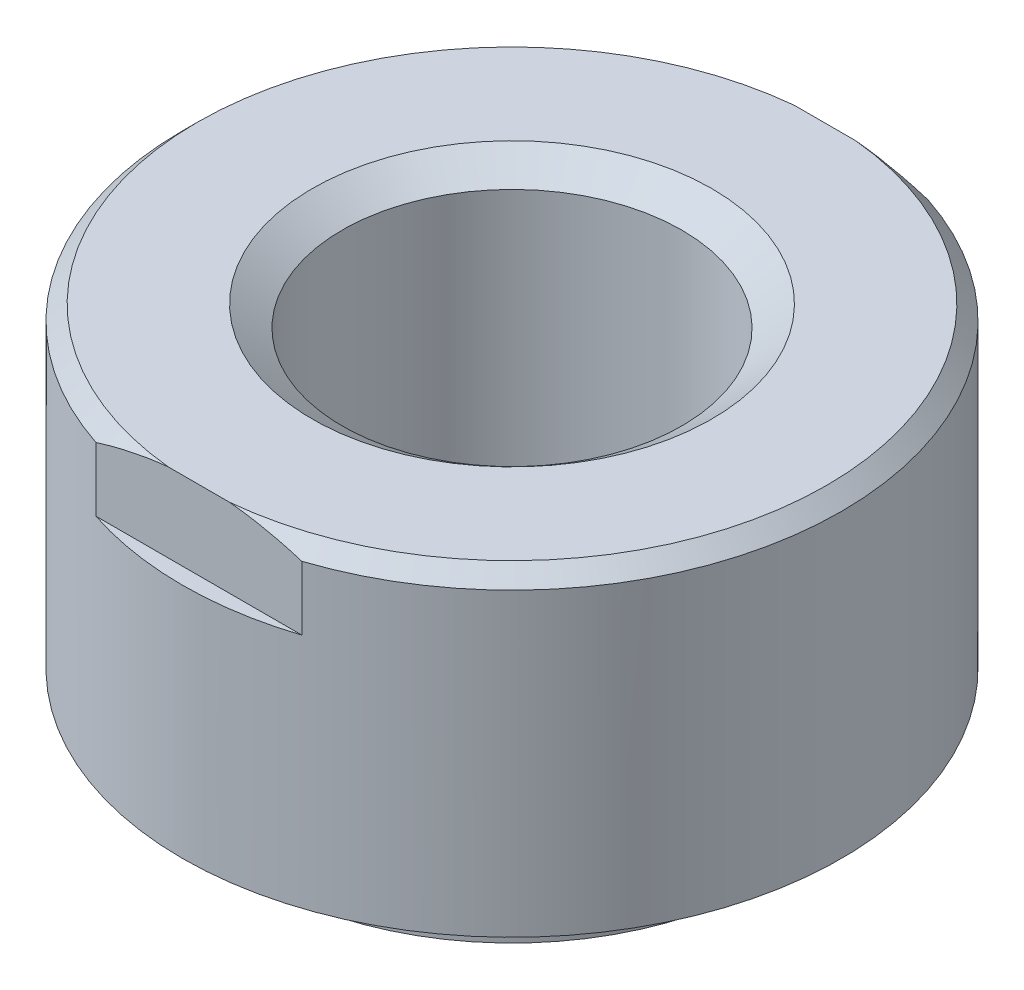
ISO-10303-21;
HEADER;
FILE_DESCRIPTION(('STEP AP214'),'2;1');
FILE_NAME('part.step','',(''),(''),'','','');
FILE_SCHEMA(('AUTOMOTIVE_DESIGN { 1 0 10303 214 1 1 1 1 }'));
ENDSEC;
DATA;
#1=APPLICATION_CONTEXT('core data for automotive mechanical design processes');
#2=APPLICATION_PROTOCOL_DEFINITION('international standard','automotive_design',2000,#1);
#3=PRODUCT_CONTEXT('',#1,'mechanical');
#4=PRODUCT('Part','Part','',(#3));
#5=PRODUCT_RELATED_PRODUCT_CATEGORY('part','',(#4));
#6=PRODUCT_DEFINITION_FORMATION('','',#4);
#7=PRODUCT_DEFINITION_CONTEXT('part definition',#1,'design');
#8=PRODUCT_DEFINITION('design','',#6,#7);
#9=PRODUCT_DEFINITION_SHAPE('','',#8);
#10=(LENGTH_UNIT() NAMED_UNIT(*) SI_UNIT(.MILLI.,.METRE.));
#11=(NAMED_UNIT(*) PLANE_ANGLE_UNIT() SI_UNIT($,.RADIAN.));
#12=(NAMED_UNIT(*) SI_UNIT($,.STERADIAN.) SOLID_ANGLE_UNIT());
#13=UNCERTAINTY_MEASURE_WITH_UNIT(LENGTH_MEASURE(1.E-05),#10,'distance_accuracy_value','');
#14=(GEOMETRIC_REPRESENTATION_CONTEXT(3) GLOBAL_UNCERTAINTY_ASSIGNED_CONTEXT((#13)) GLOBAL_UNIT_ASSIGNED_CONTEXT((#10,
#11,#12)) REPRESENTATION_CONTEXT('',''));
#15=CARTESIAN_POINT('',(0.,0.,0.));
#16=DIRECTION('',(0.,0.,1.));
#17=DIRECTION('',(1.,0.,0.));
#18=AXIS2_PLACEMENT_3D('',#15,#16,#17);
#19=CARTESIAN_POINT('',(0.,0.,0.));
#20=DIRECTION('',(0.,-1.,0.));
#21=DIRECTION('',(0.,0.,-1.));
#22=AXIS2_PLACEMENT_3D('',#19,#20,#21);
#23=CYLINDRICAL_SURFACE('',#22,7.2925);
#24=DIRECTION('',(0.,-1.,0.));
#25=VECTOR('',#24,1.);
#26=CARTESIAN_POINT('',(-7.29135648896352,-0.296,0.129138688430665));
#27=LINE('',#26,#25);
#28=CARTESIAN_POINT('',(-7.29135648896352,0.,0.129138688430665));
#29=VERTEX_POINT('',#28);
#30=CARTESIAN_POINT('',(-7.29135648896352,-0.592,0.129138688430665));
#31=VERTEX_POINT('',#30);
#32=EDGE_CURVE('E11',#29,#31,#27,.T.);
#33=ORIENTED_EDGE('',*,*,#32,.F.);
#34=CARTESIAN_POINT('',(0.,0.,0.));
#35=DIRECTION('',(0.,-1.,0.));
#36=DIRECTION('',(0.,0.,-1.));
#37=AXIS2_PLACEMENT_3D('',#34,#35,#36);
#38=CIRCLE('',#37,7.2925);
#39=CARTESIAN_POINT('',(-7.29135648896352,0.,-0.129138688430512));
#40=VERTEX_POINT('',#39);
#41=EDGE_CURVE('E533',#29,#40,#38,.T.);
#42=ORIENTED_EDGE('',*,*,#41,.T.);
#43=DIRECTION('',(0.,-1.,0.));
#44=VECTOR('',#43,1.);
#45=CARTESIAN_POINT('',(-7.29135648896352,-0.296,-0.129138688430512));
#46=LINE('',#45,#44);
#47=CARTESIAN_POINT('',(-7.29135648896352,-0.592,-0.129138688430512));
#48=VERTEX_POINT('',#47);
#49=EDGE_CURVE('E913',#48,#40,#46,.F.);
#50=ORIENTED_EDGE('',*,*,#49,.F.);
#51=CARTESIAN_POINT('',(0.,-0.592,0.));
#52=DIRECTION('',(0.,-1.,0.));
#53=DIRECTION('',(0.,0.,-1.));
#54=AXIS2_PLACEMENT_3D('',#51,#52,#53);
#55=CIRCLE('',#54,7.2925);
#56=EDGE_CURVE('E539',#31,#48,#55,.T.);
#57=ORIENTED_EDGE('',*,*,#56,.F.);
#58=EDGE_LOOP('',(#33,#42,#50,#57));
#59=FACE_BOUND('',#58,.T.);
#60=ADVANCED_FACE('F39',(#59),#23,.T.);
#61=DIRECTION('',(0.,-1.,0.));
#62=VECTOR('',#61,1.);
#63=CARTESIAN_POINT('',(-6.24993060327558,-0.296,3.75751562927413));
#64=LINE('',#63,#62);
#65=CARTESIAN_POINT('',(-6.24993060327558,0.,3.75751562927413));
#66=VERTEX_POINT('',#65);
#67=CARTESIAN_POINT('',(-6.24993060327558,-0.592,3.75751562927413));
#68=VERTEX_POINT('',#67);
#69=EDGE_CURVE('E663',#66,#68,#64,.T.);
#70=ORIENTED_EDGE('',*,*,#69,.F.);
#71=CARTESIAN_POINT('',(-6.37906929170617,0.,3.53384085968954));
#72=VERTEX_POINT('',#71);
#73=EDGE_CURVE('E550',#66,#72,#38,.T.);
#74=ORIENTED_EDGE('',*,*,#73,.T.);
#75=DIRECTION('',(0.,-1.,0.));
#76=VECTOR('',#75,1.);
#77=CARTESIAN_POINT('',(-6.37906929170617,-0.296,3.53384085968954));
#78=LINE('',#77,#76);
#79=CARTESIAN_POINT('',(-6.37906929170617,-0.592,3.53384085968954));
#80=VERTEX_POINT('',#79);
#81=EDGE_CURVE('E661',#80,#72,#78,.F.);
#82=ORIENTED_EDGE('',*,*,#81,.F.);
#83=EDGE_CURVE('E693',#68,#80,#55,.T.);
#84=ORIENTED_EDGE('',*,*,#83,.F.);
#85=EDGE_LOOP('',(#70,#74,#82,#84));
#86=FACE_BOUND('',#85,.T.);
#87=ADVANCED_FACE('F525',(#86),#23,.T.);
#88=DIRECTION('',(0.,-1.,0.));
#89=VECTOR('',#88,1.);
#90=CARTESIAN_POINT('',(-7.07633309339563,-0.296,1.76240352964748));
#91=LINE('',#90,#89);
#92=CARTESIAN_POINT('',(-7.07633309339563,-0.592,1.76240352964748));
#93=VERTEX_POINT('',#92);
#94=CARTESIAN_POINT('',(-7.07633309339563,0.,1.76240352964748));
#95=VERTEX_POINT('',#94);
#96=EDGE_CURVE('E48',#93,#95,#91,.F.);
#97=ORIENTED_EDGE('',*,*,#96,.F.);
#98=CARTESIAN_POINT('',(-7.00948598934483,-0.592,2.01188031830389));
#99=VERTEX_POINT('',#98);
#100=EDGE_CURVE('E691',#99,#93,#55,.T.);
#101=ORIENTED_EDGE('',*,*,#100,.F.);
#102=DIRECTION('',(0.,-1.,0.));
#103=VECTOR('',#102,1.);
#104=CARTESIAN_POINT('',(-7.00948598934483,-0.296,2.01188031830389));
#105=LINE('',#104,#103);
#106=CARTESIAN_POINT('',(-7.00948598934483,0.,2.01188031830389));
#107=VERTEX_POINT('',#106);
#108=EDGE_CURVE('E679',#107,#99,#105,.T.);
#109=ORIENTED_EDGE('',*,*,#108,.F.);
#110=EDGE_CURVE('E543',#107,#95,#38,.T.);
#111=ORIENTED_EDGE('',*,*,#110,.T.);
#112=EDGE_LOOP('',(#97,#101,#109,#111));
#113=FACE_BOUND('',#112,.T.);
#114=ADVANCED_FACE('F528',(#113),#23,.T.);
#115=DIRECTION('',(0.,-1.,0.));
#116=VECTOR('',#115,1.);
#117=CARTESIAN_POINT('',(-1.76240352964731,-0.296,7.07633309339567));
#118=LINE('',#117,#116);
#119=CARTESIAN_POINT('',(-1.76240352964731,0.,7.07633309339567));
#120=VERTEX_POINT('',#119);
#121=CARTESIAN_POINT('',(-1.76240352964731,-0.592,7.07633309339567));
#122=VERTEX_POINT('',#121);
#123=EDGE_CURVE('E676',#120,#122,#118,.T.);
#124=ORIENTED_EDGE('',*,*,#123,.F.);
#125=CARTESIAN_POINT('',(-2.01188031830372,0.,7.00948598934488));
#126=VERTEX_POINT('',#125);
#127=EDGE_CURVE('E634',#120,#126,#38,.T.);
#128=ORIENTED_EDGE('',*,*,#127,.T.);
#129=DIRECTION('',(0.,-1.,0.));
#130=VECTOR('',#129,1.);
#131=CARTESIAN_POINT('',(-2.01188031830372,-0.296,7.00948598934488));
#132=LINE('',#131,#130);
#133=CARTESIAN_POINT('',(-2.01188031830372,-0.592,7.00948598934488));
#134=VERTEX_POINT('',#133);
#135=EDGE_CURVE('E988',#134,#126,#132,.F.);
#136=ORIENTED_EDGE('',*,*,#135,.F.);
#137=EDGE_CURVE('E418',#122,#134,#55,.T.);
#138=ORIENTED_EDGE('',*,*,#137,.F.);
#139=EDGE_LOOP('',(#124,#128,#136,#138));
#140=FACE_BOUND('',#139,.T.);
#141=ADVANCED_FACE('F1137',(#140),#23,.T.);
#142=DIRECTION('',(0.,-1.,0.));
#143=VECTOR('',#142,1.);
#144=CARTESIAN_POINT('',(-3.53384085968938,-0.296,6.37906929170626));
#145=LINE('',#144,#143);
#146=CARTESIAN_POINT('',(-3.53384085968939,0.,6.37906929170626));
#147=VERTEX_POINT('',#146);
#148=CARTESIAN_POINT('',(-3.53384085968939,-0.592,6.37906929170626));
#149=VERTEX_POINT('',#148);
#150=EDGE_CURVE('E995',#147,#149,#145,.T.);
#151=ORIENTED_EDGE('',*,*,#150,.F.);
#152=CARTESIAN_POINT('',(-3.75751562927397,0.,6.24993060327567));
#153=VERTEX_POINT('',#152);
#154=EDGE_CURVE('E642',#147,#153,#38,.T.);
#155=ORIENTED_EDGE('',*,*,#154,.T.);
#156=DIRECTION('',(0.,-1.,0.));
#157=VECTOR('',#156,1.);
#158=CARTESIAN_POINT('',(-3.75751562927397,-0.296,6.24993060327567));
#159=LINE('',#158,#157);
#160=CARTESIAN_POINT('',(-3.75751562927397,-0.592,6.24993060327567));
#161=VERTEX_POINT('',#160);
#162=EDGE_CURVE('E982',#161,#153,#159,.F.);
#163=ORIENTED_EDGE('',*,*,#162,.F.);
#164=EDGE_CURVE('E1120',#149,#161,#55,.T.);
#165=ORIENTED_EDGE('',*,*,#164,.F.);
#166=EDGE_LOOP('',(#151,#155,#163,#165));
#167=FACE_BOUND('',#166,.T.);
#168=ADVANCED_FACE('F1135',(#167),#23,.T.);
#169=DIRECTION('',(0.,-1.,0.));
#170=VECTOR('',#169,1.);
#171=CARTESIAN_POINT('',(-5.24708245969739,-0.296,5.0644527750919));
#172=LINE('',#171,#170);
#173=CARTESIAN_POINT('',(-5.24708245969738,-0.592,5.0644527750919));
#174=VERTEX_POINT('',#173);
#175=CARTESIAN_POINT('',(-5.24708245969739,0.,5.0644527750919));
#176=VERTEX_POINT('',#175);
#177=EDGE_CURVE('E678',#174,#176,#172,.F.);
#178=ORIENTED_EDGE('',*,*,#177,.F.);
#179=CARTESIAN_POINT('',(-5.06445277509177,-0.592,5.24708245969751));
#180=VERTEX_POINT('',#179);
#181=EDGE_CURVE('E1113',#180,#174,#55,.T.);
#182=ORIENTED_EDGE('',*,*,#181,.F.);
#183=DIRECTION('',(0.,-1.,0.));
#184=VECTOR('',#183,1.);
#185=CARTESIAN_POINT('',(-5.06445277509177,-0.296,5.24708245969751));
#186=LINE('',#185,#184);
#187=CARTESIAN_POINT('',(-5.06445277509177,0.,5.24708245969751));
#188=VERTEX_POINT('',#187);
#189=EDGE_CURVE('E986',#188,#180,#186,.T.);
#190=ORIENTED_EDGE('',*,*,#189,.F.);
#191=EDGE_CURVE('E649',#188,#176,#38,.T.);
#192=ORIENTED_EDGE('',*,*,#191,.T.);
#193=EDGE_LOOP('',(#178,#182,#190,#192));
#194=FACE_BOUND('',#193,.T.);
#195=ADVANCED_FACE('F1115',(#194),#23,.T.);
#196=DIRECTION('',(0.,-1.,0.));
#197=VECTOR('',#196,1.);
#198=CARTESIAN_POINT('',(-3.75751562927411,-0.296,-6.24993060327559));
#199=LINE('',#198,#197);
#200=CARTESIAN_POINT('',(-3.7575156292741,0.,-6.24993060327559));
#201=VERTEX_POINT('',#200);
#202=CARTESIAN_POINT('',(-3.7575156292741,-0.592,-6.24993060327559));
#203=VERTEX_POINT('',#202);
#204=EDGE_CURVE('E985',#201,#203,#199,.T.);
#205=ORIENTED_EDGE('',*,*,#204,.F.);
#206=CARTESIAN_POINT('',(-3.53384085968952,0.,-6.37906929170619));
#207=VERTEX_POINT('',#206);
#208=EDGE_CURVE('E561',#201,#207,#38,.T.);
#209=ORIENTED_EDGE('',*,*,#208,.T.);
#210=DIRECTION('',(0.,-1.,0.));
#211=VECTOR('',#210,1.);
#212=CARTESIAN_POINT('',(-3.53384085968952,-0.296,-6.37906929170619));
#213=LINE('',#212,#211);
#214=CARTESIAN_POINT('',(-3.53384085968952,-0.592,-6.37906929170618));
#215=VERTEX_POINT('',#214);
#216=EDGE_CURVE('E973',#215,#207,#213,.F.);
#217=ORIENTED_EDGE('',*,*,#216,.F.);
#218=EDGE_CURVE('E932',#203,#215,#55,.T.);
#219=ORIENTED_EDGE('',*,*,#218,.F.);
#220=EDGE_LOOP('',(#205,#209,#217,#219));
#221=FACE_BOUND('',#220,.T.);
#222=ADVANCED_FACE('F1129',(#221),#23,.T.);
#223=DIRECTION('',(0.,-1.,0.));
#224=VECTOR('',#223,1.);
#225=CARTESIAN_POINT('',(-2.01188031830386,-0.296,-7.00948598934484));
#226=LINE('',#225,#224);
#227=CARTESIAN_POINT('',(-2.01188031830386,0.,-7.00948598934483));
#228=VERTEX_POINT('',#227);
#229=CARTESIAN_POINT('',(-2.01188031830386,-0.592,-7.00948598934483));
#230=VERTEX_POINT('',#229);
#231=EDGE_CURVE('E980',#228,#230,#226,.T.);
#232=ORIENTED_EDGE('',*,*,#231,.F.);
#233=CARTESIAN_POINT('',(-1.76240352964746,0.,-7.07633309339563));
#234=VERTEX_POINT('',#233);
#235=EDGE_CURVE('E570',#228,#234,#38,.T.);
#236=ORIENTED_EDGE('',*,*,#235,.T.);
#237=DIRECTION('',(0.,-1.,0.));
#238=VECTOR('',#237,1.);
#239=CARTESIAN_POINT('',(-1.76240352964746,-0.296,-7.07633309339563));
#240=LINE('',#239,#238);
#241=CARTESIAN_POINT('',(-1.76240352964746,-0.592,-7.07633309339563));
#242=VERTEX_POINT('',#241);
#243=EDGE_CURVE('E1039',#242,#234,#240,.F.);
#244=ORIENTED_EDGE('',*,*,#243,.F.);
#245=EDGE_CURVE('E933',#230,#242,#55,.T.);
#246=ORIENTED_EDGE('',*,*,#245,.F.);
#247=EDGE_LOOP('',(#232,#236,#244,#246));
#248=FACE_BOUND('',#247,.T.);
#249=ADVANCED_FACE('F1089',(#248),#23,.T.);
#250=DIRECTION('',(0.,-1.,0.));
#251=VECTOR('',#250,1.);
#252=CARTESIAN_POINT('',(-7.07633309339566,-0.296,-1.76240352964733));
#253=LINE('',#252,#251);
#254=CARTESIAN_POINT('',(-7.07633309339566,0.,-1.76240352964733));
#255=VERTEX_POINT('',#254);
#256=CARTESIAN_POINT('',(-7.07633309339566,-0.592,-1.76240352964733));
#257=VERTEX_POINT('',#256);
#258=EDGE_CURVE('E975',#255,#257,#253,.T.);
#259=ORIENTED_EDGE('',*,*,#258,.F.);
#260=CARTESIAN_POINT('',(-7.00948598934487,0.,-2.01188031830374));
#261=VERTEX_POINT('',#260);
#262=EDGE_CURVE('E549',#255,#261,#38,.T.);
#263=ORIENTED_EDGE('',*,*,#262,.T.);
#264=DIRECTION('',(0.,-1.,0.));
#265=VECTOR('',#264,1.);
#266=CARTESIAN_POINT('',(-7.00948598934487,-0.296,-2.01188031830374));
#267=LINE('',#266,#265);
#268=CARTESIAN_POINT('',(-7.00948598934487,-0.592,-2.01188031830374));
#269=VERTEX_POINT('',#268);
#270=EDGE_CURVE('E919',#269,#261,#267,.F.);
#271=ORIENTED_EDGE('',*,*,#270,.F.);
#272=EDGE_CURVE('E924',#257,#269,#55,.T.);
#273=ORIENTED_EDGE('',*,*,#272,.F.);
#274=EDGE_LOOP('',(#259,#263,#271,#273));
#275=FACE_BOUND('',#274,.T.);
#276=ADVANCED_FACE('F1119',(#275),#23,.T.);
#277=DIRECTION('',(0.,-1.,0.));
#278=VECTOR('',#277,1.);
#279=CARTESIAN_POINT('',(-6.37906929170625,-0.296,-3.53384085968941));
#280=LINE('',#279,#278);
#281=CARTESIAN_POINT('',(-6.37906929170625,0.,-3.53384085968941));
#282=VERTEX_POINT('',#281);
#283=CARTESIAN_POINT('',(-6.37906929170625,-0.592,-3.53384085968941));
#284=VERTEX_POINT('',#283);
#285=EDGE_CURVE('E906',#282,#284,#280,.T.);
#286=ORIENTED_EDGE('',*,*,#285,.F.);
#287=CARTESIAN_POINT('',(-6.24993060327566,0.,-3.757515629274));
#288=VERTEX_POINT('',#287);
#289=EDGE_CURVE('E547',#282,#288,#38,.T.);
#290=ORIENTED_EDGE('',*,*,#289,.T.);
#291=DIRECTION('',(0.,-1.,0.));
#292=VECTOR('',#291,1.);
#293=CARTESIAN_POINT('',(-6.24993060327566,-0.296,-3.757515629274));
#294=LINE('',#293,#292);
#295=CARTESIAN_POINT('',(-6.24993060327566,-0.592,-3.75751562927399));
#296=VERTEX_POINT('',#295);
#297=EDGE_CURVE('E930',#296,#288,#294,.F.);
#298=ORIENTED_EDGE('',*,*,#297,.F.);
#299=EDGE_CURVE('E922',#284,#296,#55,.T.);
#300=ORIENTED_EDGE('',*,*,#299,.F.);
#301=EDGE_LOOP('',(#286,#290,#298,#300));
#302=FACE_BOUND('',#301,.T.);
#303=ADVANCED_FACE('F927',(#302),#23,.T.);
#304=DIRECTION('',(0.,-1.,0.));
#305=VECTOR('',#304,1.);
#306=CARTESIAN_POINT('',(-5.06445277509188,-0.296,-5.2470824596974));
#307=LINE('',#306,#305);
#308=CARTESIAN_POINT('',(-5.06445277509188,-0.592,-5.2470824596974));
#309=VERTEX_POINT('',#308);
#310=CARTESIAN_POINT('',(-5.06445277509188,0.,-5.2470824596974));
#311=VERTEX_POINT('',#310);
#312=EDGE_CURVE('E978',#309,#311,#307,.F.);
#313=ORIENTED_EDGE('',*,*,#312,.F.);
#314=CARTESIAN_POINT('',(-5.24708245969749,-0.592,-5.06445277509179));
#315=VERTEX_POINT('',#314);
#316=EDGE_CURVE('E926',#315,#309,#55,.T.);
#317=ORIENTED_EDGE('',*,*,#316,.F.);
#318=DIRECTION('',(0.,-1.,0.));
#319=VECTOR('',#318,1.);
#320=CARTESIAN_POINT('',(-5.24708245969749,-0.296,-5.06445277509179));
#321=LINE('',#320,#319);
#322=CARTESIAN_POINT('',(-5.24708245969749,0.,-5.06445277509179));
#323=VERTEX_POINT('',#322);
#324=EDGE_CURVE('E966',#323,#315,#321,.T.);
#325=ORIENTED_EDGE('',*,*,#324,.F.);
#326=EDGE_CURVE('E554',#323,#311,#38,.T.);
#327=ORIENTED_EDGE('',*,*,#326,.T.);
#328=EDGE_LOOP('',(#313,#317,#325,#327));
#329=FACE_BOUND('',#328,.T.);
#330=ADVANCED_FACE('F1127',(#329),#23,.T.);
#331=DIRECTION('',(0.,-1.,0.));
#332=VECTOR('',#331,1.);
#333=CARTESIAN_POINT('',(6.24993060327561,-0.296,-3.75751562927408));
#334=LINE('',#333,#332);
#335=CARTESIAN_POINT('',(6.24993060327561,0.,-3.75751562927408));
#336=VERTEX_POINT('',#335);
#337=CARTESIAN_POINT('',(6.24993060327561,-0.592,-3.75751562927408));
#338=VERTEX_POINT('',#337);
#339=EDGE_CURVE('E961',#336,#338,#334,.T.);
#340=ORIENTED_EDGE('',*,*,#339,.F.);
#341=CARTESIAN_POINT('',(6.3790692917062,0.,-3.5338408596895));
#342=VERTEX_POINT('',#341);
#343=EDGE_CURVE('E600',#336,#342,#38,.T.);
#344=ORIENTED_EDGE('',*,*,#343,.T.);
#345=DIRECTION('',(0.,-1.,0.));
#346=VECTOR('',#345,1.);
#347=CARTESIAN_POINT('',(6.3790692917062,-0.296,-3.5338408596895));
#348=LINE('',#347,#346);
#349=CARTESIAN_POINT('',(6.3790692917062,-0.592,-3.5338408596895));
#350=VERTEX_POINT('',#349);
#351=EDGE_CURVE('E1055',#350,#342,#348,.F.);
#352=ORIENTED_EDGE('',*,*,#351,.F.);
#353=EDGE_CURVE('E406',#338,#350,#55,.T.);
#354=ORIENTED_EDGE('',*,*,#353,.F.);
#355=EDGE_LOOP('',(#340,#344,#352,#354));
#356=FACE_BOUND('',#355,.T.);
#357=ADVANCED_FACE('F1060',(#356),#23,.T.);
#358=DIRECTION('',(0.,-1.,0.));
#359=VECTOR('',#358,1.);
#360=CARTESIAN_POINT('',(5.24708245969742,-0.296,-5.06445277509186));
#361=LINE('',#360,#359);
#362=CARTESIAN_POINT('',(5.24708245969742,-0.592,-5.06445277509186));
#363=VERTEX_POINT('',#362);
#364=CARTESIAN_POINT('',(5.24708245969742,0.,-5.06445277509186));
#365=VERTEX_POINT('',#364);
#366=EDGE_CURVE('E959',#363,#365,#361,.F.);
#367=ORIENTED_EDGE('',*,*,#366,.F.);
#368=CARTESIAN_POINT('',(5.06445277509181,-0.592,-5.24708245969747));
#369=VERTEX_POINT('',#368);
#370=EDGE_CURVE('E414',#369,#363,#55,.T.);
#371=ORIENTED_EDGE('',*,*,#370,.F.);
#372=DIRECTION('',(0.,-1.,0.));
#373=VECTOR('',#372,1.);
#374=CARTESIAN_POINT('',(5.06445277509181,-0.296,-5.24708245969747));
#375=LINE('',#374,#373);
#376=CARTESIAN_POINT('',(5.06445277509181,0.,-5.24708245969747));
#377=VERTEX_POINT('',#376);
#378=EDGE_CURVE('E958',#377,#369,#375,.T.);
#379=ORIENTED_EDGE('',*,*,#378,.F.);
#380=EDGE_CURVE('E594',#377,#365,#38,.T.);
#381=ORIENTED_EDGE('',*,*,#380,.T.);
#382=EDGE_LOOP('',(#367,#371,#379,#381));
#383=FACE_BOUND('',#382,.T.);
#384=ADVANCED_FACE('F960',(#383),#23,.T.);
#385=DIRECTION('',(0.,-1.,0.));
#386=VECTOR('',#385,1.);
#387=CARTESIAN_POINT('',(7.00948598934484,-0.296,-2.01188031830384));
#388=LINE('',#387,#386);
#389=CARTESIAN_POINT('',(7.00948598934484,0.,-2.01188031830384));
#390=VERTEX_POINT('',#389);
#391=CARTESIAN_POINT('',(7.00948598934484,-0.592,-2.01188031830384));
#392=VERTEX_POINT('',#391);
#393=EDGE_CURVE('E1053',#390,#392,#388,.T.);
#394=ORIENTED_EDGE('',*,*,#393,.F.);
#395=CARTESIAN_POINT('',(7.07633309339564,0.,-1.76240352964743));
#396=VERTEX_POINT('',#395);
#397=EDGE_CURVE('E397',#390,#396,#38,.T.);
#398=ORIENTED_EDGE('',*,*,#397,.T.);
#399=DIRECTION('',(0.,-1.,0.));
#400=VECTOR('',#399,1.);
#401=CARTESIAN_POINT('',(7.07633309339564,-0.296,-1.76240352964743));
#402=LINE('',#401,#400);
#403=CARTESIAN_POINT('',(7.07633309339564,-0.592,-1.76240352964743));
#404=VERTEX_POINT('',#403);
#405=EDGE_CURVE('E384',#404,#396,#402,.F.);
#406=ORIENTED_EDGE('',*,*,#405,.F.);
#407=EDGE_CURVE('E400',#392,#404,#55,.T.);
#408=ORIENTED_EDGE('',*,*,#407,.F.);
#409=EDGE_LOOP('',(#394,#398,#406,#408));
#410=FACE_BOUND('',#409,.T.);
#411=ADVANCED_FACE('F396',(#410),#23,.T.);
#412=DIRECTION('',(0.,-1.,0.));
#413=VECTOR('',#412,1.);
#414=CARTESIAN_POINT('',(3.75751562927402,-0.296,-6.24993060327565));
#415=LINE('',#414,#413);
#416=CARTESIAN_POINT('',(3.75751562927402,-0.592,-6.24993060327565));
#417=VERTEX_POINT('',#416);
#418=CARTESIAN_POINT('',(3.75751562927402,0.,-6.24993060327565));
#419=VERTEX_POINT('',#418);
#420=EDGE_CURVE('E963',#417,#419,#415,.F.);
#421=ORIENTED_EDGE('',*,*,#420,.F.);
#422=CARTESIAN_POINT('',(3.53384085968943,-0.592,-6.37906929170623));
#423=VERTEX_POINT('',#422);
#424=EDGE_CURVE('E950',#423,#417,#55,.T.);
#425=ORIENTED_EDGE('',*,*,#424,.F.);
#426=DIRECTION('',(0.,-1.,0.));
#427=VECTOR('',#426,1.);
#428=CARTESIAN_POINT('',(3.53384085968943,-0.296,-6.37906929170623));
#429=LINE('',#428,#427);
#430=CARTESIAN_POINT('',(3.53384085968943,0.,-6.37906929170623));
#431=VERTEX_POINT('',#430);
#432=EDGE_CURVE('E1047',#431,#423,#429,.T.);
#433=ORIENTED_EDGE('',*,*,#432,.F.);
#434=EDGE_CURVE('E583',#431,#419,#38,.T.);
#435=ORIENTED_EDGE('',*,*,#434,.T.);
#436=EDGE_LOOP('',(#421,#425,#433,#435));
#437=FACE_BOUND('',#436,.T.);
#438=ADVANCED_FACE('F1059',(#437),#23,.T.);
#439=DIRECTION('',(0.,-1.,0.));
#440=VECTOR('',#439,1.);
#441=CARTESIAN_POINT('',(2.01188031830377,-0.296,-7.00948598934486));
#442=LINE('',#441,#440);
#443=CARTESIAN_POINT('',(2.01188031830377,-0.592,-7.00948598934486));
#444=VERTEX_POINT('',#443);
#445=CARTESIAN_POINT('',(2.01188031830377,0.,-7.00948598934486));
#446=VERTEX_POINT('',#445);
#447=EDGE_CURVE('E1046',#444,#446,#442,.F.);
#448=ORIENTED_EDGE('',*,*,#447,.F.);
#449=CARTESIAN_POINT('',(1.76240352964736,-0.592,-7.07633309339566));
#450=VERTEX_POINT('',#449);
#451=EDGE_CURVE('E941',#450,#444,#55,.T.);
#452=ORIENTED_EDGE('',*,*,#451,.F.);
#453=DIRECTION('',(0.,-1.,0.));
#454=VECTOR('',#453,1.);
#455=CARTESIAN_POINT('',(1.76240352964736,-0.296,-7.07633309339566));
#456=LINE('',#455,#454);
#457=CARTESIAN_POINT('',(1.76240352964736,0.,-7.07633309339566));
#458=VERTEX_POINT('',#457);
#459=EDGE_CURVE('E1043',#458,#450,#456,.T.);
#460=ORIENTED_EDGE('',*,*,#459,.F.);
#461=EDGE_CURVE('E576',#458,#446,#38,.T.);
#462=ORIENTED_EDGE('',*,*,#461,.T.);
#463=EDGE_LOOP('',(#448,#452,#460,#462));
#464=FACE_BOUND('',#463,.T.);
#465=ADVANCED_FACE('F1086',(#464),#23,.T.);
#466=DIRECTION('',(0.,-1.,0.));
#467=VECTOR('',#466,1.);
#468=CARTESIAN_POINT('',(0.129138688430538,-0.296,-7.29135648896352));
#469=LINE('',#468,#467);
#470=CARTESIAN_POINT('',(0.129138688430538,-0.592,-7.29135648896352));
#471=VERTEX_POINT('',#470);
#472=CARTESIAN_POINT('',(0.129138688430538,0.,-7.29135648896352));
#473=VERTEX_POINT('',#472);
#474=EDGE_CURVE('E1044',#471,#473,#469,.F.);
#475=ORIENTED_EDGE('',*,*,#474,.F.);
#476=CARTESIAN_POINT('',(-0.12913868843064,-0.592,-7.29135648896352));
#477=VERTEX_POINT('',#476);
#478=EDGE_CURVE('E938',#477,#471,#55,.T.);
#479=ORIENTED_EDGE('',*,*,#478,.F.);
#480=DIRECTION('',(0.,-1.,0.));
#481=VECTOR('',#480,1.);
#482=CARTESIAN_POINT('',(-0.12913868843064,-0.296,-7.29135648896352));
#483=LINE('',#482,#481);
#484=CARTESIAN_POINT('',(-0.12913868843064,0.,-7.29135648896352));
#485=VERTEX_POINT('',#484);
#486=EDGE_CURVE('E1038',#485,#477,#483,.T.);
#487=ORIENTED_EDGE('',*,*,#486,.F.);
#488=EDGE_CURVE('E572',#485,#473,#38,.T.);
#489=ORIENTED_EDGE('',*,*,#488,.T.);
#490=EDGE_LOOP('',(#475,#479,#487,#489));
#491=FACE_BOUND('',#490,.T.);
#492=ADVANCED_FACE('F1085',(#491),#23,.T.);
#493=DIRECTION('',(0.,-1.,0.));
#494=VECTOR('',#493,1.);
#495=CARTESIAN_POINT('',(5.24708245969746,-0.296,5.06445277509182));
#496=LINE('',#495,#494);
#497=CARTESIAN_POINT('',(5.24708245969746,0.,5.06445277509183));
#498=VERTEX_POINT('',#497);
#499=CARTESIAN_POINT('',(5.24708245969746,-0.592,5.06445277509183));
#500=VERTEX_POINT('',#499);
#501=EDGE_CURVE('E1033',#498,#500,#496,.T.);
#502=ORIENTED_EDGE('',*,*,#501,.F.);
#503=CARTESIAN_POINT('',(5.06445277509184,0.,5.24708245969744));
#504=VERTEX_POINT('',#503);
#505=EDGE_CURVE('E619',#498,#504,#38,.T.);
#506=ORIENTED_EDGE('',*,*,#505,.T.);
#507=DIRECTION('',(0.,-1.,0.));
#508=VECTOR('',#507,1.);
#509=CARTESIAN_POINT('',(5.06445277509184,-0.296,5.24708245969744));
#510=LINE('',#509,#508);
#511=CARTESIAN_POINT('',(5.06445277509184,-0.592,5.24708245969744));
#512=VERTEX_POINT('',#511);
#513=EDGE_CURVE('E1028',#512,#504,#510,.F.);
#514=ORIENTED_EDGE('',*,*,#513,.F.);
#515=EDGE_CURVE('E1066',#500,#512,#55,.T.);
#516=ORIENTED_EDGE('',*,*,#515,.F.);
#517=EDGE_LOOP('',(#502,#506,#514,#516));
#518=FACE_BOUND('',#517,.T.);
#519=ADVANCED_FACE('F1080',(#518),#23,.T.);
#520=DIRECTION('',(0.,-1.,0.));
#521=VECTOR('',#520,1.);
#522=CARTESIAN_POINT('',(3.75751562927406,-0.296,6.24993060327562));
#523=LINE('',#522,#521);
#524=CARTESIAN_POINT('',(3.75751562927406,0.,6.24993060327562));
#525=VERTEX_POINT('',#524);
#526=CARTESIAN_POINT('',(3.75751562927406,-0.592,6.24993060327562));
#527=VERTEX_POINT('',#526);
#528=EDGE_CURVE('E1032',#525,#527,#523,.T.);
#529=ORIENTED_EDGE('',*,*,#528,.F.);
#530=CARTESIAN_POINT('',(3.53384085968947,0.,6.37906929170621));
#531=VERTEX_POINT('',#530);
#532=EDGE_CURVE('E622',#525,#531,#38,.T.);
#533=ORIENTED_EDGE('',*,*,#532,.T.);
#534=DIRECTION('',(0.,-1.,0.));
#535=VECTOR('',#534,1.);
#536=CARTESIAN_POINT('',(3.53384085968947,-0.296,6.37906929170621));
#537=LINE('',#536,#535);
#538=CARTESIAN_POINT('',(3.53384085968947,-0.592,6.37906929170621));
#539=VERTEX_POINT('',#538);
#540=EDGE_CURVE('E1015',#539,#531,#537,.F.);
#541=ORIENTED_EDGE('',*,*,#540,.F.);
#542=EDGE_CURVE('E417',#527,#539,#55,.T.);
#543=ORIENTED_EDGE('',*,*,#542,.F.);
#544=EDGE_LOOP('',(#529,#533,#541,#543));
#545=FACE_BOUND('',#544,.T.);
#546=ADVANCED_FACE('F1075',(#545),#23,.T.);
#547=DIRECTION('',(0.,-1.,0.));
#548=VECTOR('',#547,1.);
#549=CARTESIAN_POINT('',(6.24993060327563,-0.296,3.75751562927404));
#550=LINE('',#549,#548);
#551=CARTESIAN_POINT('',(6.24993060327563,-0.592,3.75751562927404));
#552=VERTEX_POINT('',#551);
#553=CARTESIAN_POINT('',(6.24993060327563,0.,3.75751562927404));
#554=VERTEX_POINT('',#553);
#555=EDGE_CURVE('E1034',#552,#554,#550,.F.);
#556=ORIENTED_EDGE('',*,*,#555,.F.);
#557=CARTESIAN_POINT('',(6.37906929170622,-0.592,3.53384085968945));
#558=VERTEX_POINT('',#557);
#559=EDGE_CURVE('E1063',#558,#552,#55,.T.);
#560=ORIENTED_EDGE('',*,*,#559,.F.);
#561=DIRECTION('',(0.,-1.,0.));
#562=VECTOR('',#561,1.);
#563=CARTESIAN_POINT('',(6.37906929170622,-0.296,3.53384085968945));
#564=LINE('',#563,#562);
#565=CARTESIAN_POINT('',(6.37906929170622,0.,3.53384085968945));
#566=VERTEX_POINT('',#565);
#567=EDGE_CURVE('E1030',#566,#558,#564,.T.);
#568=ORIENTED_EDGE('',*,*,#567,.F.);
#569=EDGE_CURVE('E613',#566,#554,#38,.T.);
#570=ORIENTED_EDGE('',*,*,#569,.T.);
#571=EDGE_LOOP('',(#556,#560,#568,#570));
#572=FACE_BOUND('',#571,.T.);
#573=ADVANCED_FACE('F1078',(#572),#23,.T.);
#574=DIRECTION('',(0.,-1.,0.));
#575=VECTOR('',#574,1.);
#576=CARTESIAN_POINT('',(7.00948598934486,-0.296,2.01188031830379));
#577=LINE('',#576,#575);
#578=CARTESIAN_POINT('',(7.00948598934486,-0.592,2.01188031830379));
#579=VERTEX_POINT('',#578);
#580=CARTESIAN_POINT('',(7.00948598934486,0.,2.01188031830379));
#581=VERTEX_POINT('',#580);
#582=EDGE_CURVE('E1022',#579,#581,#577,.F.);
#583=ORIENTED_EDGE('',*,*,#582,.F.);
#584=CARTESIAN_POINT('',(7.07633309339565,-0.592,1.76240352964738));
#585=VERTEX_POINT('',#584);
#586=EDGE_CURVE('E415',#585,#579,#55,.T.);
#587=ORIENTED_EDGE('',*,*,#586,.F.);
#588=DIRECTION('',(0.,-1.,0.));
#589=VECTOR('',#588,1.);
#590=CARTESIAN_POINT('',(7.07633309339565,-0.296,1.76240352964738));
#591=LINE('',#590,#589);
#592=CARTESIAN_POINT('',(7.07633309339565,0.,1.76240352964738));
#593=VERTEX_POINT('',#592);
#594=EDGE_CURVE('E1025',#593,#585,#591,.T.);
#595=ORIENTED_EDGE('',*,*,#594,.F.);
#596=EDGE_CURVE('E606',#593,#581,#38,.T.);
#597=ORIENTED_EDGE('',*,*,#596,.T.);
#598=EDGE_LOOP('',(#583,#587,#595,#597));
#599=FACE_BOUND('',#598,.T.);
#600=ADVANCED_FACE('F1061',(#599),#23,.T.);
#601=DIRECTION('',(0.,-1.,0.));
#602=VECTOR('',#601,1.);
#603=CARTESIAN_POINT('',(7.29135648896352,-0.296,0.129138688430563));
#604=LINE('',#603,#602);
#605=CARTESIAN_POINT('',(7.29135648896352,-0.592,0.129138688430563));
#606=VERTEX_POINT('',#605);
#607=CARTESIAN_POINT('',(7.29135648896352,0.,0.129138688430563));
#608=VERTEX_POINT('',#607);
#609=EDGE_CURVE('E1017',#606,#608,#604,.F.);
#610=ORIENTED_EDGE('',*,*,#609,.F.);
#611=CARTESIAN_POINT('',(7.29135648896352,-0.592,-0.129138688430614));
#612=VERTEX_POINT('',#611);
#613=EDGE_CURVE('E408',#612,#606,#55,.T.);
#614=ORIENTED_EDGE('',*,*,#613,.F.);
#615=DIRECTION('',(0.,-1.,0.));
#616=VECTOR('',#615,1.);
#617=CARTESIAN_POINT('',(7.29135648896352,-0.296,-0.129138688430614));
#618=LINE('',#617,#616);
#619=CARTESIAN_POINT('',(7.29135648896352,0.,-0.129138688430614));
#620=VERTEX_POINT('',#619);
#621=EDGE_CURVE('E387',#620,#612,#618,.T.);
#622=ORIENTED_EDGE('',*,*,#621,.F.);
#623=EDGE_CURVE('E609',#620,#608,#38,.T.);
#624=ORIENTED_EDGE('',*,*,#623,.T.);
#625=EDGE_LOOP('',(#610,#614,#622,#624));
#626=FACE_BOUND('',#625,.T.);
#627=ADVANCED_FACE('F1056',(#626),#23,.T.);
#628=DIRECTION('',(0.,-1.,0.));
#629=VECTOR('',#628,1.);
#630=CARTESIAN_POINT('',(2.01188031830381,-0.296,7.00948598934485));
#631=LINE('',#630,#629);
#632=CARTESIAN_POINT('',(2.01188031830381,0.,7.00948598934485));
#633=VERTEX_POINT('',#632);
#634=CARTESIAN_POINT('',(2.01188031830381,-0.592,7.00948598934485));
#635=VERTEX_POINT('',#634);
#636=EDGE_CURVE('E402',#633,#635,#631,.T.);
#637=ORIENTED_EDGE('',*,*,#636,.F.);
#638=CARTESIAN_POINT('',(1.76240352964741,0.,7.07633309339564));
#639=VERTEX_POINT('',#638);
#640=EDGE_CURVE('E627',#633,#639,#38,.T.);
#641=ORIENTED_EDGE('',*,*,#640,.T.);
#642=DIRECTION('',(0.,-1.,0.));
#643=VECTOR('',#642,1.);
#644=CARTESIAN_POINT('',(1.76240352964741,-0.296,7.07633309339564));
#645=LINE('',#644,#643);
#646=CARTESIAN_POINT('',(1.76240352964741,-0.592,7.07633309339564));
#647=VERTEX_POINT('',#646);
#648=EDGE_CURVE('E1008',#647,#639,#645,.F.);
#649=ORIENTED_EDGE('',*,*,#648,.F.);
#650=EDGE_CURVE('E423',#635,#647,#55,.T.);
#651=ORIENTED_EDGE('',*,*,#650,.F.);
#652=EDGE_LOOP('',(#637,#641,#649,#651));
#653=FACE_BOUND('',#652,.T.);
#654=ADVANCED_FACE('F471',(#653),#23,.T.);
#655=CARTESIAN_POINT('',(0.,7.525,0.));
#656=DIRECTION('',(0.,-1.,0.));
#657=DIRECTION('',(0.,0.,-1.));
#658=AXIS2_PLACEMENT_3D('',#655,#656,#657);
#659=CONICAL_SURFACE('',#658,8.25,0.785398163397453);
#660=CARTESIAN_POINT('',(-16.3736422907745,-2.37775648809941,-7.8375));
#661=CARTESIAN_POINT('',(-16.1349347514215,-2.16244772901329,-7.8375));
#662=CARTESIAN_POINT('',(-15.8957952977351,-1.94761873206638,-7.8375));
#663=CARTESIAN_POINT('',(-15.4165348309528,-1.51905791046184,-7.8375));
#664=CARTESIAN_POINT('',(-15.1764138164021,-1.30532608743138,-7.8375));
#665=CARTESIAN_POINT('',(-14.4542589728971,-0.665856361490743,-7.8375));
#666=CARTESIAN_POINT('',(-13.9705759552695,-0.241973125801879,-7.8375));
#667=CARTESIAN_POINT('',(-13.2383891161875,0.391040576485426,-7.8375));
#668=CARTESIAN_POINT('',(-12.991990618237,0.602607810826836,-7.8375));
#669=CARTESIAN_POINT('',(-12.4975405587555,1.02379239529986,-7.8375));
#670=CARTESIAN_POINT('',(-12.2494890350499,1.23340978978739,-7.8375));
#671=CARTESIAN_POINT('',(-11.7515273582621,1.65033107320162,-7.8375));
#672=CARTESIAN_POINT('',(-11.5016175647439,1.85763539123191,-7.8375));
#673=CARTESIAN_POINT('',(-10.999572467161,2.26957886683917,-7.8375));
#674=CARTESIAN_POINT('',(-10.7474369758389,2.47421779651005,-7.8375));
#675=CARTESIAN_POINT('',(-10.2659094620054,2.86002123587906,-7.8375));
#676=CARTESIAN_POINT('',(-10.0367607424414,3.04148913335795,-7.8375));
#677=CARTESIAN_POINT('',(-9.57607273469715,3.40136323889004,-7.8375));
#678=CARTESIAN_POINT('',(-9.3445334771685,3.57976948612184,-7.8375));
#679=CARTESIAN_POINT('',(-8.87871370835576,3.93291862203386,-7.8375));
#680=CARTESIAN_POINT('',(-8.64443350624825,4.10766191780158,-7.8375));
#681=CARTESIAN_POINT('',(-8.17267085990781,4.45276165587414,-7.8375));
#682=CARTESIAN_POINT('',(-7.93518854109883,4.62311826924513,-7.8375));
#683=CARTESIAN_POINT('',(-7.45697979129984,4.95816599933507,-7.8375));
#684=CARTESIAN_POINT('',(-7.21626106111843,5.12286807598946,-7.8375));
#685=CARTESIAN_POINT('',(-6.7304745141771,5.44578167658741,-7.8375));
#686=CARTESIAN_POINT('',(-6.48540646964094,5.60399285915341,-7.8375));
#687=CARTESIAN_POINT('',(-5.99041662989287,5.9122409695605,-7.8375));
#688=CARTESIAN_POINT('',(-5.74049864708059,6.06228399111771,-7.8375));
#689=CARTESIAN_POINT('',(-5.23489222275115,6.35228212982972,-7.8375));
#690=CARTESIAN_POINT('',(-4.97920473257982,6.49223889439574,-7.8375));
#691=CARTESIAN_POINT('',(-4.47657456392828,6.75155415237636,-7.8375));
#692=CARTESIAN_POINT('',(-4.23001049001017,6.87164160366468,-7.8375));
#693=CARTESIAN_POINT('',(-3.73046726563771,7.09783419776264,-7.8375));
#694=CARTESIAN_POINT('',(-3.47748767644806,7.20393838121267,-7.8375));
#695=CARTESIAN_POINT('',(-2.96546109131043,7.39857763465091,-7.8375));
#696=CARTESIAN_POINT('',(-2.70642970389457,7.48715329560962,-7.8375));
#697=CARTESIAN_POINT('',(-2.18212025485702,7.64323813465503,-7.8375));
#698=CARTESIAN_POINT('',(-1.91684532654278,7.71075764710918,-7.8375));
#699=CARTESIAN_POINT('',(-1.42352473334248,7.81232815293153,-7.8375));
#700=CARTESIAN_POINT('',(-1.19622553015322,7.84998326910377,-7.8375));
#701=CARTESIAN_POINT('',(-0.739254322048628,7.90597648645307,-7.8375));
#702=CARTESIAN_POINT('',(-0.509582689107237,7.92431757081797,-7.8375));
#703=CARTESIAN_POINT('',(-0.0497911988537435,7.9407047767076,-7.8375));
#704=CARTESIAN_POINT('',(0.180327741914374,7.93877618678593,-7.8375));
#705=CARTESIAN_POINT('',(0.639519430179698,7.91479828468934,-7.8375));
#706=CARTESIAN_POINT('',(0.868592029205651,7.89274620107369,-7.8375));
#707=CARTESIAN_POINT('',(1.38075939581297,7.82178453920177,-7.8375));
#708=CARTESIAN_POINT('',(1.66311915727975,7.76755898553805,-7.8375));
#709=CARTESIAN_POINT('',(2.22158739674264,7.63324382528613,-7.8375));
#710=CARTESIAN_POINT('',(2.49769321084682,7.55314341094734,-7.8375));
#711=CARTESIAN_POINT('',(3.04409620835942,7.37106179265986,-7.8375));
#712=CARTESIAN_POINT('',(3.31435593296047,7.26896948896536,-7.8375));
#713=CARTESIAN_POINT('',(3.71419552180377,7.10280472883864,-7.8375));
#714=CARTESIAN_POINT('',(3.8465460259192,7.04524758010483,-7.8375));
#715=CARTESIAN_POINT('',(4.10948777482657,6.92624000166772,-7.8375));
#716=CARTESIAN_POINT('',(4.24007902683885,6.86478958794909,-7.8375));
#717=CARTESIAN_POINT('',(4.57682413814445,6.70080506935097,-7.8375));
#718=CARTESIAN_POINT('',(4.78167447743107,6.59559347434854,-7.8375));
#719=CARTESIAN_POINT('',(5.18745370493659,6.37783144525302,-7.8375));
#720=CARTESIAN_POINT('',(5.38838194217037,6.26527980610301,-7.8375));
#721=CARTESIAN_POINT('',(5.78679797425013,6.03399887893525,-7.8375));
#722=CARTESIAN_POINT('',(5.9842836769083,5.91526599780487,-7.8375));
#723=CARTESIAN_POINT('',(6.37608148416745,5.6726636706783,-7.8375));
#724=CARTESIAN_POINT('',(6.57039335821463,5.54879385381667,-7.8375));
#725=CARTESIAN_POINT('',(7.15004182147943,5.1701204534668,-7.8375));
#726=CARTESIAN_POINT('',(7.53113497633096,4.90881840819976,-7.8375));
#727=CARTESIAN_POINT('',(8.28429008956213,4.37386709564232,-7.8375));
#728=CARTESIAN_POINT('',(8.65635471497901,4.10022154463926,-7.8375));
#729=CARTESIAN_POINT('',(9.39522219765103,3.54235172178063,-7.8375));
#730=CARTESIAN_POINT('',(9.7619916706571,3.25808337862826,-7.8375));
#731=CARTESIAN_POINT('',(10.4899210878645,2.68243409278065,-7.8375));
#732=CARTESIAN_POINT('',(10.8510806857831,2.39105271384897,-7.8375));
#733=CARTESIAN_POINT('',(11.5683891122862,1.80317548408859,-7.8375));
#734=CARTESIAN_POINT('',(11.9245440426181,1.50668706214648,-7.8375));
#735=CARTESIAN_POINT('',(12.6331698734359,0.909364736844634,-7.8375));
#736=CARTESIAN_POINT('',(12.9856408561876,0.608530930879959,-7.8375));
#737=CARTESIAN_POINT('',(13.8499969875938,-0.136661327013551,-7.8375));
#738=CARTESIAN_POINT('',(14.3601659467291,-0.583009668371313,-7.8375));
#739=CARTESIAN_POINT('',(15.1199846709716,-1.2551686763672,-7.8375));
#740=CARTESIAN_POINT('',(15.3714943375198,-1.47888569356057,-7.8375));
#741=CARTESIAN_POINT('',(15.873374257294,-1.92747908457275,-7.8375));
#742=CARTESIAN_POINT('',(16.1237447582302,-2.15235518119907,-7.8375));
#743=CARTESIAN_POINT('',(16.3736422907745,-2.37775648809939,-7.8375));
#744=B_SPLINE_CURVE_WITH_KNOTS('',3,(#660,#661,#662,#663,#664,#665,#666,#667,#668,#669,#670,
#671,#672,#673,#674,#675,#676,#677,#678,#679,#680,#681,#682,#683,#684,#685,#686,#687,#688,#689,
#690,#691,#692,#693,#694,#695,#696,#697,#698,#699,#700,#701,#702,#703,#704,#705,#706,#707,#708,
#709,#710,#711,#712,#713,#714,#715,#716,#717,#718,#719,#720,#721,#722,#723,#724,#725,#726,#727,
#728,#729,#730,#731,#732,#733,#734,#735,#736,#737,#738,#739,#740,#741,#742,#743),.UNSPECIFIED.,
.F.,.F.,(4,2,2,2,2,2,2,2,2,2,2,2,2,2,2,2,2,2,2,2,2,2,2,2,2,2,2,2,2,2,2,2,2,2,2,2,2,2,2,2,2,4),
(0.,0.96438990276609,1.92878123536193,3.85814062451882,4.83243074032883,5.80669863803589,
6.78078268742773,7.75494948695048,8.63183014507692,9.50869957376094,10.3854710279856,
11.2622082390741,12.1371372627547,13.0121122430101,13.886425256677,14.7605951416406,
15.5830058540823,16.4054729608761,17.2260125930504,18.046148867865,18.7365917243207,
19.4269279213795,20.1164029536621,20.8059729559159,21.6670596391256,22.5285064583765,
23.3944117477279,23.8273352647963,24.2602570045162,24.9509335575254,25.6417237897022,
26.3329201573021,27.0241665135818,28.4099887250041,29.7953964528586,31.1873842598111,
32.5794576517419,33.9696533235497,35.3598178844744,37.3933462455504,38.4031743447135,
39.4127712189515),.UNSPECIFIED.);
#745=CARTESIAN_POINT('',(-2.57606167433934,7.525,-7.8375));
#746=VERTEX_POINT('',#745);
#747=CARTESIAN_POINT('',(-0.767605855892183,7.9,-7.8375));
#748=VERTEX_POINT('',#747);
#749=EDGE_CURVE('E788',#746,#748,#744,.T.);
#750=ORIENTED_EDGE('',*,*,#749,.F.);
#751=CARTESIAN_POINT('',(0.,7.525,0.));
#752=DIRECTION('',(0.,1.,0.));
#753=DIRECTION('',(0.,0.,1.));
#754=AXIS2_PLACEMENT_3D('',#751,#752,#753);
#755=CIRCLE('',#754,8.25);
#756=CARTESIAN_POINT('',(-2.57606167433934,7.525,7.8375));
#757=VERTEX_POINT('',#756);
#758=EDGE_CURVE('E444',#757,#746,#755,.F.);
#759=ORIENTED_EDGE('',*,*,#758,.F.);
#760=CARTESIAN_POINT('',(16.3736422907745,-2.37775648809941,7.8375));
#761=CARTESIAN_POINT('',(16.1349347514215,-2.16244772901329,7.8375));
#762=CARTESIAN_POINT('',(15.8957952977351,-1.94761873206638,7.8375));
#763=CARTESIAN_POINT('',(15.4165348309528,-1.51905791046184,7.8375));
#764=CARTESIAN_POINT('',(15.1764138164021,-1.30532608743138,7.8375));
#765=CARTESIAN_POINT('',(14.4542589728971,-0.665856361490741,7.8375));
#766=CARTESIAN_POINT('',(13.9705759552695,-0.241973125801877,7.8375));
#767=CARTESIAN_POINT('',(13.2383891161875,0.391040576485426,7.8375));
#768=CARTESIAN_POINT('',(12.9919906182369,0.602607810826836,7.8375));
#769=CARTESIAN_POINT('',(12.4975405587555,1.02379239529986,7.8375));
#770=CARTESIAN_POINT('',(12.2494890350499,1.23340978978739,7.8375));
#771=CARTESIAN_POINT('',(11.7515273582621,1.65033107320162,7.8375));
#772=CARTESIAN_POINT('',(11.5016175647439,1.85763539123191,7.8375));
#773=CARTESIAN_POINT('',(10.999572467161,2.26957886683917,7.8375));
#774=CARTESIAN_POINT('',(10.7474369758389,2.47421779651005,7.8375));
#775=CARTESIAN_POINT('',(10.2659094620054,2.86002123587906,7.8375));
#776=CARTESIAN_POINT('',(10.0367607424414,3.04148913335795,7.8375));
#777=CARTESIAN_POINT('',(9.57607273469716,3.40136323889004,7.8375));
#778=CARTESIAN_POINT('',(9.3445334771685,3.57976948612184,7.8375));
#779=CARTESIAN_POINT('',(8.87871370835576,3.93291862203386,7.8375));
#780=CARTESIAN_POINT('',(8.64443350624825,4.10766191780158,7.8375));
#781=CARTESIAN_POINT('',(8.17267085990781,4.45276165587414,7.8375));
#782=CARTESIAN_POINT('',(7.93518854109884,4.62311826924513,7.8375));
#783=CARTESIAN_POINT('',(7.45697979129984,4.95816599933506,7.8375));
#784=CARTESIAN_POINT('',(7.21626106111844,5.12286807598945,7.8375));
#785=CARTESIAN_POINT('',(6.73047451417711,5.44578167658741,7.8375));
#786=CARTESIAN_POINT('',(6.48540646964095,5.6039928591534,7.8375));
#787=CARTESIAN_POINT('',(5.99041662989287,5.91224096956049,7.8375));
#788=CARTESIAN_POINT('',(5.74049864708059,6.0622839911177,7.8375));
#789=CARTESIAN_POINT('',(5.23489222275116,6.35228212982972,7.8375));
#790=CARTESIAN_POINT('',(4.97920473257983,6.49223889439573,7.8375));
#791=CARTESIAN_POINT('',(4.47657456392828,6.75155415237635,7.8375));
#792=CARTESIAN_POINT('',(4.23001049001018,6.87164160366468,7.8375));
#793=CARTESIAN_POINT('',(3.73046726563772,7.09783419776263,7.8375));
#794=CARTESIAN_POINT('',(3.47748767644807,7.20393838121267,7.8375));
#795=CARTESIAN_POINT('',(2.96546109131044,7.3985776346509,7.8375));
#796=CARTESIAN_POINT('',(2.70642970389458,7.48715329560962,7.8375));
#797=CARTESIAN_POINT('',(2.18212025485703,7.64323813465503,7.8375));
#798=CARTESIAN_POINT('',(1.91684532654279,7.71075764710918,7.8375));
#799=CARTESIAN_POINT('',(1.42352473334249,7.81232815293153,7.8375));
#800=CARTESIAN_POINT('',(1.19622553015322,7.84998326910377,7.8375));
#801=CARTESIAN_POINT('',(0.739254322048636,7.90597648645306,7.8375));
#802=CARTESIAN_POINT('',(0.509582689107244,7.92431757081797,7.8375));
#803=CARTESIAN_POINT('',(0.0497911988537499,7.9407047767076,7.8375));
#804=CARTESIAN_POINT('',(-0.180327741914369,7.93877618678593,7.8375));
#805=CARTESIAN_POINT('',(-0.639519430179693,7.91479828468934,7.8375));
#806=CARTESIAN_POINT('',(-0.868592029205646,7.89274620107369,7.8375));
#807=CARTESIAN_POINT('',(-1.38075939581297,7.82178453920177,7.8375));
#808=CARTESIAN_POINT('',(-1.66311915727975,7.76755898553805,7.8375));
#809=CARTESIAN_POINT('',(-2.22158739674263,7.63324382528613,7.8375));
#810=CARTESIAN_POINT('',(-2.49769321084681,7.55314341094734,7.8375));
#811=CARTESIAN_POINT('',(-3.04409620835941,7.37106179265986,7.8375));
#812=CARTESIAN_POINT('',(-3.31435593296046,7.26896948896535,7.8375));
#813=CARTESIAN_POINT('',(-3.71419552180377,7.10280472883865,7.8375));
#814=CARTESIAN_POINT('',(-3.8465460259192,7.04524758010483,7.8375));
#815=CARTESIAN_POINT('',(-4.10948777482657,6.92624000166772,7.8375));
#816=CARTESIAN_POINT('',(-4.24007902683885,6.86478958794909,7.8375));
#817=CARTESIAN_POINT('',(-4.57682413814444,6.70080506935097,7.8375));
#818=CARTESIAN_POINT('',(-4.78167447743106,6.59559347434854,7.8375));
#819=CARTESIAN_POINT('',(-5.18745370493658,6.37783144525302,7.8375));
#820=CARTESIAN_POINT('',(-5.38838194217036,6.26527980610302,7.8375));
#821=CARTESIAN_POINT('',(-5.78679797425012,6.03399887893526,7.8375));
#822=CARTESIAN_POINT('',(-5.9842836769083,5.91526599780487,7.8375));
#823=CARTESIAN_POINT('',(-6.37608148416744,5.6726636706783,7.8375));
#824=CARTESIAN_POINT('',(-6.57039335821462,5.54879385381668,7.8375));
#825=CARTESIAN_POINT('',(-7.15004182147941,5.17012045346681,7.8375));
#826=CARTESIAN_POINT('',(-7.53113497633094,4.90881840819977,7.8375));
#827=CARTESIAN_POINT('',(-8.28429008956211,4.37386709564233,7.8375));
#828=CARTESIAN_POINT('',(-8.65635471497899,4.10022154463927,7.8375));
#829=CARTESIAN_POINT('',(-9.39522219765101,3.54235172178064,7.8375));
#830=CARTESIAN_POINT('',(-9.76199167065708,3.25808337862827,7.8375));
#831=CARTESIAN_POINT('',(-10.4899210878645,2.68243409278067,7.8375));
#832=CARTESIAN_POINT('',(-10.8510806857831,2.39105271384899,7.8375));
#833=CARTESIAN_POINT('',(-11.5683891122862,1.80317548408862,7.8375));
#834=CARTESIAN_POINT('',(-11.924544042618,1.50668706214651,7.8375));
#835=CARTESIAN_POINT('',(-12.6331698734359,0.909364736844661,7.8375));
#836=CARTESIAN_POINT('',(-12.9856408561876,0.608530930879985,7.8375));
#837=CARTESIAN_POINT('',(-13.8499969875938,-0.136661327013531,7.8375));
#838=CARTESIAN_POINT('',(-14.360165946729,-0.583009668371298,7.8375));
#839=CARTESIAN_POINT('',(-15.1199846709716,-1.25516867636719,7.8375));
#840=CARTESIAN_POINT('',(-15.3714943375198,-1.47888569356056,7.8375));
#841=CARTESIAN_POINT('',(-15.873374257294,-1.92747908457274,7.8375));
#842=CARTESIAN_POINT('',(-16.1237447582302,-2.15235518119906,7.8375));
#843=CARTESIAN_POINT('',(-16.3736422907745,-2.37775648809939,7.8375));
#844=B_SPLINE_CURVE_WITH_KNOTS('',3,(#760,#761,#762,#763,#764,#765,#766,#767,#768,#769,#770,
#771,#772,#773,#774,#775,#776,#777,#778,#779,#780,#781,#782,#783,#784,#785,#786,#787,#788,#789,
#790,#791,#792,#793,#794,#795,#796,#797,#798,#799,#800,#801,#802,#803,#804,#805,#806,#807,#808,
#809,#810,#811,#812,#813,#814,#815,#816,#817,#818,#819,#820,#821,#822,#823,#824,#825,#826,#827,
#828,#829,#830,#831,#832,#833,#834,#835,#836,#837,#838,#839,#840,#841,#842,#843),.UNSPECIFIED.,
.F.,.F.,(4,2,2,2,2,2,2,2,2,2,2,2,2,2,2,2,2,2,2,2,2,2,2,2,2,2,2,2,2,2,2,2,2,2,2,2,2,2,2,2,2,4),
(0.,0.964389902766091,1.92878123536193,3.85814062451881,4.83243074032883,5.80669863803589,
6.78078268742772,7.75494948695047,8.63183014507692,9.50869957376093,10.3854710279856,
11.2622082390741,12.1371372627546,13.0121122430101,13.886425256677,14.7605951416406,
15.5830058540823,16.4054729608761,17.2260125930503,18.046148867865,18.7365917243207,
19.4269279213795,20.1164029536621,20.8059729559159,21.6670596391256,22.5285064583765,
23.3944117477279,23.8273352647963,24.2602570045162,24.9509335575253,25.6417237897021,
26.3329201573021,27.0241665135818,28.4099887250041,29.7953964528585,31.1873842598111,
32.5794576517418,33.9696533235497,35.3598178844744,37.3933462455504,38.4031743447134,
39.4127712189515),.UNSPECIFIED.);
#845=CARTESIAN_POINT('',(-0.767605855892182,7.9,7.8375));
#846=VERTEX_POINT('',#845);
#847=EDGE_CURVE('E454',#846,#757,#844,.T.);
#848=ORIENTED_EDGE('',*,*,#847,.F.);
#849=CARTESIAN_POINT('',(0.,7.9,0.));
#850=DIRECTION('',(0.,1.,0.));
#851=DIRECTION('',(0.,0.,1.));
#852=AXIS2_PLACEMENT_3D('',#849,#850,#851);
#853=CIRCLE('',#852,7.875);
#854=EDGE_CURVE('E449',#748,#846,#853,.T.);
#855=ORIENTED_EDGE('',*,*,#854,.F.);
#856=EDGE_LOOP('',(#750,#759,#848,#855));
#857=FACE_BOUND('',#856,.T.);
#858=ADVANCED_FACE('F511',(#857),#659,.T.);
#859=CARTESIAN_POINT('',(7.2925,0.,0.));
#860=DIRECTION('',(0.,-1.,0.));
#861=DIRECTION('',(0.,0.,-1.));
#862=AXIS2_PLACEMENT_3D('',#859,#860,#861);
#863=PLANE('',#862);
#864=ORIENTED_EDGE('',*,*,#41,.F.);
#865=CARTESIAN_POINT('',(-7.2301116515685,0.,0.951862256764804));
#866=DIRECTION('',(0.,-1.,0.));
#867=DIRECTION('',(1.,0.,0.));
#868=AXIS2_PLACEMENT_3D('',#865,#866,#867);
#869=CIRCLE('',#868,0.825);
#870=EDGE_CURVE('E538',#29,#95,#869,.T.);
#871=ORIENTED_EDGE('',*,*,#870,.T.);
#872=ORIENTED_EDGE('',*,*,#110,.F.);
#873=CARTESIAN_POINT('',(-6.73739149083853,0.,2.79071893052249));
#874=DIRECTION('',(0.,-1.,0.));
#875=DIRECTION('',(0.965925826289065,0.,-0.258819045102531));
#876=AXIS2_PLACEMENT_3D('',#873,#874,#875);
#877=CIRCLE('',#876,0.825);
#878=EDGE_CURVE('E670',#107,#72,#877,.T.);
#879=ORIENTED_EDGE('',*,*,#878,.T.);
#880=ORIENTED_EDGE('',*,*,#73,.F.);
#881=CARTESIAN_POINT('',(-5.78552923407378,0.,4.43939272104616));
#882=DIRECTION('',(0.,-1.,0.));
#883=DIRECTION('',(0.866025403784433,0.,-0.50000000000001));
#884=AXIS2_PLACEMENT_3D('',#881,#882,#883);
#885=CIRCLE('',#884,0.825);
#886=EDGE_CURVE('E667',#66,#176,#885,.T.);
#887=ORIENTED_EDGE('',*,*,#886,.T.);
#888=ORIENTED_EDGE('',*,*,#191,.F.);
#889=CARTESIAN_POINT('',(-4.43939272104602,0.,5.78552923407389));
#890=DIRECTION('',(0.,-1.,0.));
#891=DIRECTION('',(0.707106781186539,0.,-0.707106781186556));
#892=AXIS2_PLACEMENT_3D('',#889,#890,#891);
#893=CIRCLE('',#892,0.825);
#894=EDGE_CURVE('E1107',#188,#153,#893,.T.);
#895=ORIENTED_EDGE('',*,*,#894,.T.);
#896=ORIENTED_EDGE('',*,*,#154,.F.);
#897=CARTESIAN_POINT('',(-2.79071893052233,0.,6.73739149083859));
#898=DIRECTION('',(0.,-1.,0.));
#899=DIRECTION('',(0.499999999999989,0.,-0.866025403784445));
#900=AXIS2_PLACEMENT_3D('',#897,#898,#899);
#901=CIRCLE('',#900,0.825);
#902=EDGE_CURVE('E1096',#147,#126,#901,.T.);
#903=ORIENTED_EDGE('',*,*,#902,.T.);
#904=ORIENTED_EDGE('',*,*,#127,.F.);
#905=CARTESIAN_POINT('',(-0.951862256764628,0.,7.23011165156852));
#906=DIRECTION('',(0.,-1.,0.));
#907=DIRECTION('',(0.258819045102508,0.,-0.965925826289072));
#908=AXIS2_PLACEMENT_3D('',#905,#906,#907);
#909=CIRCLE('',#908,0.825);
#910=CARTESIAN_POINT('',(-0.129138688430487,0.,7.29135648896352));
#911=VERTEX_POINT('',#910);
#912=EDGE_CURVE('E993',#120,#911,#909,.T.);
#913=ORIENTED_EDGE('',*,*,#912,.T.);
#914=CARTESIAN_POINT('',(0.129138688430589,0.,7.29135648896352));
#915=VERTEX_POINT('',#914);
#916=EDGE_CURVE('E422',#915,#911,#38,.T.);
#917=ORIENTED_EDGE('',*,*,#916,.F.);
#918=CARTESIAN_POINT('',(0.951862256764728,0.,7.23011165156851));
#919=DIRECTION('',(0.,-1.,0.));
#920=DIRECTION('',(0.,0.,-1.));
#921=AXIS2_PLACEMENT_3D('',#918,#919,#920);
#922=CIRCLE('',#921,0.825);
#923=EDGE_CURVE('E745',#915,#639,#922,.T.);
#924=ORIENTED_EDGE('',*,*,#923,.T.);
#925=ORIENTED_EDGE('',*,*,#640,.F.);
#926=CARTESIAN_POINT('',(2.79071893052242,0.,6.73739149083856));
#927=DIRECTION('',(0.,-1.,0.));
#928=DIRECTION('',(-0.258819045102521,0.,-0.965925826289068));
#929=AXIS2_PLACEMENT_3D('',#926,#927,#928);
#930=CIRCLE('',#929,0.825);
#931=EDGE_CURVE('E740',#633,#531,#930,.T.);
#932=ORIENTED_EDGE('',*,*,#931,.T.);
#933=ORIENTED_EDGE('',*,*,#532,.F.);
#934=CARTESIAN_POINT('',(4.4393927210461,0.,5.78552923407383));
#935=DIRECTION('',(0.,-1.,0.));
#936=DIRECTION('',(-0.500000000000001,0.,-0.866025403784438));
#937=AXIS2_PLACEMENT_3D('',#934,#935,#936);
#938=CIRCLE('',#937,0.825);
#939=EDGE_CURVE('E54',#525,#504,#938,.T.);
#940=ORIENTED_EDGE('',*,*,#939,.T.);
#941=ORIENTED_EDGE('',*,*,#505,.F.);
#942=CARTESIAN_POINT('',(5.78552923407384,0.,4.43939272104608));
#943=DIRECTION('',(0.,-1.,0.));
#944=DIRECTION('',(-0.707106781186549,0.,-0.707106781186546));
#945=AXIS2_PLACEMENT_3D('',#942,#943,#944);
#946=CIRCLE('',#945,0.825);
#947=EDGE_CURVE('E62',#498,#554,#946,.T.);
#948=ORIENTED_EDGE('',*,*,#947,.T.);
#949=ORIENTED_EDGE('',*,*,#569,.F.);
#950=CARTESIAN_POINT('',(6.73739149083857,0.,2.7907189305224));
#951=DIRECTION('',(0.,-1.,0.));
#952=DIRECTION('',(-0.86602540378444,0.,-0.499999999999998));
#953=AXIS2_PLACEMENT_3D('',#950,#951,#952);
#954=CIRCLE('',#953,0.825);
#955=EDGE_CURVE('E697',#566,#581,#954,.T.);
#956=ORIENTED_EDGE('',*,*,#955,.T.);
#957=ORIENTED_EDGE('',*,*,#596,.F.);
#958=CARTESIAN_POINT('',(7.23011165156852,0.,0.951862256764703));
#959=DIRECTION('',(0.,-1.,0.));
#960=DIRECTION('',(-0.965925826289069,0.,-0.258819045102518));
#961=AXIS2_PLACEMENT_3D('',#958,#959,#960);
#962=CIRCLE('',#961,0.825);
#963=EDGE_CURVE('E703',#593,#608,#962,.T.);
#964=ORIENTED_EDGE('',*,*,#963,.T.);
#965=ORIENTED_EDGE('',*,*,#623,.F.);
#966=CARTESIAN_POINT('',(7.23011165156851,0.,-0.951862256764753));
#967=DIRECTION('',(0.,-1.,0.));
#968=DIRECTION('',(-1.,0.,0.));
#969=AXIS2_PLACEMENT_3D('',#966,#967,#968);
#970=CIRCLE('',#969,0.825);
#971=EDGE_CURVE('E392',#620,#396,#970,.T.);
#972=ORIENTED_EDGE('',*,*,#971,.T.);
#973=ORIENTED_EDGE('',*,*,#397,.F.);
#974=CARTESIAN_POINT('',(6.73739149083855,0.,-2.79071893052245));
#975=DIRECTION('',(0.,-1.,0.));
#976=DIRECTION('',(-0.965925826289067,0.,0.258819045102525));
#977=AXIS2_PLACEMENT_3D('',#974,#975,#976);
#978=CIRCLE('',#977,0.825);
#979=EDGE_CURVE('E394',#390,#342,#978,.T.);
#980=ORIENTED_EDGE('',*,*,#979,.T.);
#981=ORIENTED_EDGE('',*,*,#343,.F.);
#982=CARTESIAN_POINT('',(5.78552923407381,0.,-4.43939272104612));
#983=DIRECTION('',(0.,-1.,0.));
#984=DIRECTION('',(-0.866025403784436,0.,0.500000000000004));
#985=AXIS2_PLACEMENT_3D('',#982,#983,#984);
#986=CIRCLE('',#985,0.825);
#987=EDGE_CURVE('E735',#336,#365,#986,.T.);
#988=ORIENTED_EDGE('',*,*,#987,.T.);
#989=ORIENTED_EDGE('',*,*,#380,.F.);
#990=CARTESIAN_POINT('',(4.43939272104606,0.,-5.78552923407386));
#991=DIRECTION('',(0.,-1.,0.));
#992=DIRECTION('',(-0.707106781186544,0.,0.707106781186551));
#993=AXIS2_PLACEMENT_3D('',#990,#991,#992);
#994=CIRCLE('',#993,0.825);
#995=EDGE_CURVE('E729',#377,#419,#994,.T.);
#996=ORIENTED_EDGE('',*,*,#995,.T.);
#997=ORIENTED_EDGE('',*,*,#434,.F.);
#998=CARTESIAN_POINT('',(2.79071893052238,0.,-6.73739149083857));
#999=DIRECTION('',(0.,-1.,0.));
#1000=DIRECTION('',(-0.499999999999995,0.,0.866025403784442));
#1001=AXIS2_PLACEMENT_3D('',#998,#999,#1000);
#1002=CIRCLE('',#1001,0.825);
#1003=EDGE_CURVE('E713',#431,#446,#1002,.T.);
#1004=ORIENTED_EDGE('',*,*,#1003,.T.);
#1005=ORIENTED_EDGE('',*,*,#461,.F.);
#1006=CARTESIAN_POINT('',(0.951862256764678,0.,-7.23011165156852));
#1007=DIRECTION('',(0.,-1.,0.));
#1008=DIRECTION('',(-0.258819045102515,0.,0.96592582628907));
#1009=AXIS2_PLACEMENT_3D('',#1006,#1007,#1008);
#1010=CIRCLE('',#1009,0.825);
#1011=EDGE_CURVE('E718',#458,#473,#1010,.T.);
#1012=ORIENTED_EDGE('',*,*,#1011,.T.);
#1013=ORIENTED_EDGE('',*,*,#488,.F.);
#1014=CARTESIAN_POINT('',(-0.951862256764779,0.,-7.2301116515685));
#1015=DIRECTION('',(0.,-1.,0.));
#1016=DIRECTION('',(0.,0.,1.));
#1017=AXIS2_PLACEMENT_3D('',#1014,#1015,#1016);
#1018=CIRCLE('',#1017,0.825);
#1019=EDGE_CURVE('E723',#485,#234,#1018,.T.);
#1020=ORIENTED_EDGE('',*,*,#1019,.T.);
#1021=ORIENTED_EDGE('',*,*,#235,.F.);
#1022=CARTESIAN_POINT('',(-2.79071893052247,0.,-6.73739149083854));
#1023=DIRECTION('',(0.,-1.,0.));
#1024=DIRECTION('',(0.258819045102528,0.,0.965925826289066));
#1025=AXIS2_PLACEMENT_3D('',#1022,#1023,#1024);
#1026=CIRCLE('',#1025,0.825);
#1027=EDGE_CURVE('E726',#228,#207,#1026,.T.);
#1028=ORIENTED_EDGE('',*,*,#1027,.T.);
#1029=ORIENTED_EDGE('',*,*,#208,.F.);
#1030=CARTESIAN_POINT('',(-4.43939272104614,0.,-5.78552923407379));
#1031=DIRECTION('',(0.,-1.,0.));
#1032=DIRECTION('',(0.500000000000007,0.,0.866025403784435));
#1033=AXIS2_PLACEMENT_3D('',#1030,#1031,#1032);
#1034=CIRCLE('',#1033,0.825);
#1035=EDGE_CURVE('E1095',#201,#311,#1034,.T.);
#1036=ORIENTED_EDGE('',*,*,#1035,.T.);
#1037=ORIENTED_EDGE('',*,*,#326,.F.);
#1038=CARTESIAN_POINT('',(-5.78552923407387,0.,-4.43939272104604));
#1039=DIRECTION('',(0.,-1.,0.));
#1040=DIRECTION('',(0.707106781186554,0.,0.707106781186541));
#1041=AXIS2_PLACEMENT_3D('',#1038,#1039,#1040);
#1042=CIRCLE('',#1041,0.825);
#1043=EDGE_CURVE('E1124',#323,#288,#1042,.T.);
#1044=ORIENTED_EDGE('',*,*,#1043,.T.);
#1045=ORIENTED_EDGE('',*,*,#289,.F.);
#1046=CARTESIAN_POINT('',(-6.73739149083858,0.,-2.79071893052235));
#1047=DIRECTION('',(0.,-1.,0.));
#1048=DIRECTION('',(0.866025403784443,0.,0.499999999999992));
#1049=AXIS2_PLACEMENT_3D('',#1046,#1047,#1048);
#1050=CIRCLE('',#1049,0.825);
#1051=EDGE_CURVE('E915',#282,#261,#1050,.T.);
#1052=ORIENTED_EDGE('',*,*,#1051,.T.);
#1053=ORIENTED_EDGE('',*,*,#262,.F.);
#1054=CARTESIAN_POINT('',(-7.23011165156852,0.,-0.951862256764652));
#1055=DIRECTION('',(0.,-1.,0.));
#1056=DIRECTION('',(0.965925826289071,0.,0.258819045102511));
#1057=AXIS2_PLACEMENT_3D('',#1054,#1055,#1056);
#1058=CIRCLE('',#1057,0.825);
#1059=EDGE_CURVE('E545',#255,#40,#1058,.T.);
#1060=ORIENTED_EDGE('',*,*,#1059,.T.);
#1061=EDGE_LOOP('',(#864,#871,#872,#879,#880,#887,#888,#895,#896,#903,#904,#913,#917,#924,#925,
#932,#933,#940,#941,#948,#949,#956,#957,#964,#965,#972,#973,#980,#981,#988,#989,#996,#997,#1004,
#1005,#1012,#1013,#1020,#1021,#1028,#1029,#1036,#1037,#1044,#1045,#1052,#1053,#1060));
#1062=FACE_BOUND('',#1061,.T.);
#1063=CARTESIAN_POINT('',(0.,0.,0.));
#1064=DIRECTION('',(0.,-1.,0.));
#1065=DIRECTION('',(0.,0.,-1.));
#1066=AXIS2_PLACEMENT_3D('',#1063,#1064,#1065);
#1067=CIRCLE('',#1066,8.25);
#1068=CARTESIAN_POINT('',(0.,0.,-8.25));
#1069=VERTEX_POINT('',#1068);
#1070=EDGE_CURVE('E441',#1069,#1069,#1067,.T.);
#1071=ORIENTED_EDGE('',*,*,#1070,.T.);
#1072=EDGE_LOOP('',(#1071));
#1073=FACE_BOUND('',#1072,.T.);
#1074=ADVANCED_FACE('F512',(#1062,#1073),#863,.T.);
#1075=CARTESIAN_POINT('',(0.,0.,0.));
#1076=DIRECTION('',(0.,-1.,0.));
#1077=DIRECTION('',(0.,0.,-1.));
#1078=AXIS2_PLACEMENT_3D('',#1075,#1076,#1077);
#1079=CYLINDRICAL_SURFACE('',#1078,8.25);
#1080=DIRECTION('',(0.,-1.,0.));
#1081=VECTOR('',#1080,1.);
#1082=CARTESIAN_POINT('',(-2.57606167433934,0.,-7.8375));
#1083=LINE('',#1082,#1081);
#1084=CARTESIAN_POINT('',(-2.57606167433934,5.925,-7.8375));
#1085=VERTEX_POINT('',#1084);
#1086=EDGE_CURVE('E767',#1085,#746,#1083,.F.);
#1087=ORIENTED_EDGE('',*,*,#1086,.F.);
#1088=CARTESIAN_POINT('',(0.,5.925,0.));
#1089=DIRECTION('',(0.,-1.,0.));
#1090=DIRECTION('',(0.,0.,-1.));
#1091=AXIS2_PLACEMENT_3D('',#1088,#1089,#1090);
#1092=CIRCLE('',#1091,8.25);
#1093=CARTESIAN_POINT('',(2.57606167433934,5.925,-7.8375));
#1094=VERTEX_POINT('',#1093);
#1095=EDGE_CURVE('E795',#1094,#1085,#1092,.F.);
#1096=ORIENTED_EDGE('',*,*,#1095,.F.);
#1097=DIRECTION('',(0.,-1.,0.));
#1098=VECTOR('',#1097,1.);
#1099=CARTESIAN_POINT('',(2.57606167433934,0.,-7.8375));
#1100=LINE('',#1099,#1098);
#1101=CARTESIAN_POINT('',(2.57606167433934,7.525,-7.8375));
#1102=VERTEX_POINT('',#1101);
#1103=EDGE_CURVE('E762',#1102,#1094,#1100,.T.);
#1104=ORIENTED_EDGE('',*,*,#1103,.F.);
#1105=CARTESIAN_POINT('',(2.57606167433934,7.525,7.8375));
#1106=VERTEX_POINT('',#1105);
#1107=EDGE_CURVE('E443',#1102,#1106,#755,.F.);
#1108=ORIENTED_EDGE('',*,*,#1107,.T.);
#1109=DIRECTION('',(0.,-1.,0.));
#1110=VECTOR('',#1109,1.);
#1111=CARTESIAN_POINT('',(2.57606167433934,0.,7.8375));
#1112=LINE('',#1111,#1110);
#1113=CARTESIAN_POINT('',(2.57606167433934,5.925,7.8375));
#1114=VERTEX_POINT('',#1113);
#1115=EDGE_CURVE('E632',#1114,#1106,#1112,.F.);
#1116=ORIENTED_EDGE('',*,*,#1115,.F.);
#1117=CARTESIAN_POINT('',(0.,5.925,0.));
#1118=DIRECTION('',(0.,1.,0.));
#1119=DIRECTION('',(0.,0.,1.));
#1120=AXIS2_PLACEMENT_3D('',#1117,#1118,#1119);
#1121=CIRCLE('',#1120,8.25);
#1122=CARTESIAN_POINT('',(-2.57606167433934,5.925,7.8375));
#1123=VERTEX_POINT('',#1122);
#1124=EDGE_CURVE('E458',#1114,#1123,#1121,.F.);
#1125=ORIENTED_EDGE('',*,*,#1124,.T.);
#1126=DIRECTION('',(0.,-1.,0.));
#1127=VECTOR('',#1126,1.);
#1128=CARTESIAN_POINT('',(-2.57606167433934,0.,7.8375));
#1129=LINE('',#1128,#1127);
#1130=EDGE_CURVE('E771',#757,#1123,#1129,.T.);
#1131=ORIENTED_EDGE('',*,*,#1130,.F.);
#1132=ORIENTED_EDGE('',*,*,#758,.T.);
#1133=EDGE_LOOP('',(#1087,#1096,#1104,#1108,#1116,#1125,#1131,#1132));
#1134=FACE_BOUND('',#1133,.T.);
#1135=ORIENTED_EDGE('',*,*,#1070,.F.);
#1136=EDGE_LOOP('',(#1135));
#1137=FACE_BOUND('',#1136,.T.);
#1138=ADVANCED_FACE('F507',(#1134,#1137),#1079,.T.);
#1139=CARTESIAN_POINT('',(8.25,7.9,0.));
#1140=DIRECTION('',(0.,1.,0.));
#1141=DIRECTION('',(0.,0.,1.));
#1142=AXIS2_PLACEMENT_3D('',#1139,#1140,#1141);
#1143=PLANE('',#1142);
#1144=CARTESIAN_POINT('',(0.,7.9,0.));
#1145=DIRECTION('',(0.,-1.,0.));
#1146=DIRECTION('',(0.,0.,-1.));
#1147=AXIS2_PLACEMENT_3D('',#1144,#1145,#1146);
#1148=CIRCLE('',#1147,5.);
#1149=CARTESIAN_POINT('',(0.,7.9,-5.));
#1150=VERTEX_POINT('',#1149);
#1151=EDGE_CURVE('E753',#1150,#1150,#1148,.T.);
#1152=ORIENTED_EDGE('',*,*,#1151,.T.);
#1153=EDGE_LOOP('',(#1152));
#1154=FACE_BOUND('',#1153,.T.);
#1155=DIRECTION('',(1.,0.,0.));
#1156=VECTOR('',#1155,1.);
#1157=CARTESIAN_POINT('',(8.24999999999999,7.9,-7.8375));
#1158=LINE('',#1157,#1156);
#1159=CARTESIAN_POINT('',(0.767605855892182,7.9,-7.8375));
#1160=VERTEX_POINT('',#1159);
#1161=EDGE_CURVE('E764',#748,#1160,#1158,.T.);
#1162=ORIENTED_EDGE('',*,*,#1161,.F.);
#1163=ORIENTED_EDGE('',*,*,#854,.T.);
#1164=DIRECTION('',(-1.,0.,0.));
#1165=VECTOR('',#1164,1.);
#1166=CARTESIAN_POINT('',(8.24999999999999,7.9,7.8375));
#1167=LINE('',#1166,#1165);
#1168=CARTESIAN_POINT('',(0.767605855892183,7.9,7.8375));
#1169=VERTEX_POINT('',#1168);
#1170=EDGE_CURVE('E769',#1169,#846,#1167,.T.);
#1171=ORIENTED_EDGE('',*,*,#1170,.F.);
#1172=EDGE_CURVE('E446',#1169,#1160,#853,.T.);
#1173=ORIENTED_EDGE('',*,*,#1172,.T.);
#1174=EDGE_LOOP('',(#1162,#1163,#1171,#1173));
#1175=FACE_BOUND('',#1174,.T.);
#1176=ADVANCED_FACE('F502',(#1154,#1175),#1143,.T.);
#1177=CARTESIAN_POINT('',(0.,0.,0.));
#1178=DIRECTION('',(0.,-1.,0.));
#1179=DIRECTION('',(0.,0.,-1.));
#1180=AXIS2_PLACEMENT_3D('',#1177,#1178,#1179);
#1181=CYLINDRICAL_SURFACE('',#1180,4.25);
#1182=CARTESIAN_POINT('',(0.,7.37503940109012,0.));
#1183=DIRECTION('',(0.,-1.,0.));
#1184=DIRECTION('',(0.,0.,-1.));
#1185=AXIS2_PLACEMENT_3D('',#1182,#1183,#1184);
#1186=CIRCLE('',#1185,4.25);
#1187=CARTESIAN_POINT('',(0.,7.37503940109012,-4.25));
#1188=VERTEX_POINT('',#1187);
#1189=EDGE_CURVE('E748',#1188,#1188,#1186,.T.);
#1190=ORIENTED_EDGE('',*,*,#1189,.F.);
#1191=EDGE_LOOP('',(#1190));
#1192=FACE_BOUND('',#1191,.T.);
#1193=CARTESIAN_POINT('',(0.,-0.952499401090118,0.));
#1194=DIRECTION('',(0.,-1.,0.));
#1195=DIRECTION('',(0.,0.,-1.));
#1196=AXIS2_PLACEMENT_3D('',#1193,#1194,#1195);
#1197=CIRCLE('',#1196,4.25);
#1198=CARTESIAN_POINT('',(0.,-0.952499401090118,-4.25));
#1199=VERTEX_POINT('',#1198);
#1200=EDGE_CURVE('E754',#1199,#1199,#1197,.T.);
#1201=ORIENTED_EDGE('',*,*,#1200,.T.);
#1202=EDGE_LOOP('',(#1201));
#1203=FACE_BOUND('',#1202,.T.);
#1204=ADVANCED_FACE('F499',(#1192,#1203),#1181,.F.);
#1205=CARTESIAN_POINT('',(4.25,-1.48,0.));
#1206=DIRECTION('',(0.,-1.,0.));
#1207=DIRECTION('',(0.,0.,-1.));
#1208=AXIS2_PLACEMENT_3D('',#1205,#1206,#1207);
#1209=PLANE('',#1208);
#1210=CARTESIAN_POINT('',(0.,-1.48,0.));
#1211=DIRECTION('',(0.,-1.,0.));
#1212=DIRECTION('',(0.,0.,-1.));
#1213=AXIS2_PLACEMENT_3D('',#1210,#1211,#1212);
#1214=CIRCLE('',#1213,5.);
#1215=CARTESIAN_POINT('',(0.,-1.48,-5.));
#1216=VERTEX_POINT('',#1215);
#1217=EDGE_CURVE('E759',#1216,#1216,#1214,.T.);
#1218=ORIENTED_EDGE('',*,*,#1217,.F.);
#1219=EDGE_LOOP('',(#1218));
#1220=FACE_BOUND('',#1219,.T.);
#1221=CARTESIAN_POINT('',(0.,-1.48,0.));
#1222=DIRECTION('',(0.,-1.,0.));
#1223=DIRECTION('',(0.,0.,-1.));
#1224=AXIS2_PLACEMENT_3D('',#1221,#1222,#1223);
#1225=CIRCLE('',#1224,6.335);
#1226=CARTESIAN_POINT('',(0.,-1.48,-6.335));
#1227=VERTEX_POINT('',#1226);
#1228=EDGE_CURVE('E438',#1227,#1227,#1225,.T.);
#1229=ORIENTED_EDGE('',*,*,#1228,.T.);
#1230=EDGE_LOOP('',(#1229));
#1231=FACE_BOUND('',#1230,.T.);
#1232=ADVANCED_FACE('F496',(#1220,#1231),#1209,.T.);
#1233=CARTESIAN_POINT('',(0.,0.,0.));
#1234=DIRECTION('',(0.,-1.,0.));
#1235=DIRECTION('',(0.,0.,-1.));
#1236=AXIS2_PLACEMENT_3D('',#1233,#1234,#1235);
#1237=CYLINDRICAL_SURFACE('',#1236,6.335);
#1238=CARTESIAN_POINT('',(0.,-1.353,0.));
#1239=DIRECTION('',(0.,-1.,0.));
#1240=DIRECTION('',(0.,0.,-1.));
#1241=AXIS2_PLACEMENT_3D('',#1238,#1239,#1240);
#1242=CIRCLE('',#1241,6.335);
#1243=CARTESIAN_POINT('',(0.,-1.353,-6.335));
#1244=VERTEX_POINT('',#1243);
#1245=EDGE_CURVE('E434',#1244,#1244,#1242,.T.);
#1246=ORIENTED_EDGE('',*,*,#1245,.T.);
#1247=EDGE_LOOP('',(#1246));
#1248=FACE_BOUND('',#1247,.T.);
#1249=ORIENTED_EDGE('',*,*,#1228,.F.);
#1250=EDGE_LOOP('',(#1249));
#1251=FACE_BOUND('',#1250,.T.);
#1252=ADVANCED_FACE('F495',(#1248,#1251),#1237,.T.);
#1253=CARTESIAN_POINT('',(0.,-1.353,0.));
#1254=DIRECTION('',(0.,-1.,0.));
#1255=DIRECTION('',(0.,0.,-1.));
#1256=AXIS2_PLACEMENT_3D('',#1253,#1254,#1255);
#1257=CONICAL_SURFACE('',#1256,6.335,0.523598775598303);
#1258=CARTESIAN_POINT('',(0.,-0.592,0.));
#1259=DIRECTION('',(0.,-1.,0.));
#1260=DIRECTION('',(0.,0.,-1.));
#1261=AXIS2_PLACEMENT_3D('',#1258,#1259,#1260);
#1262=CIRCLE('',#1261,5.89563644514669);
#1263=CARTESIAN_POINT('',(0.,-0.592,-5.89563644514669));
#1264=VERTEX_POINT('',#1263);
#1265=EDGE_CURVE('E435',#1264,#1264,#1262,.T.);
#1266=ORIENTED_EDGE('',*,*,#1265,.T.);
#1267=EDGE_LOOP('',(#1266));
#1268=FACE_BOUND('',#1267,.T.);
#1269=ORIENTED_EDGE('',*,*,#1245,.F.);
#1270=EDGE_LOOP('',(#1269));
#1271=FACE_BOUND('',#1270,.T.);
#1272=ADVANCED_FACE('F486',(#1268,#1271),#1257,.T.);
#1273=CARTESIAN_POINT('',(0.,0.,0.));
#1274=DIRECTION('',(0.,-1.,0.));
#1275=DIRECTION('',(0.,0.,-1.));
#1276=AXIS2_PLACEMENT_3D('',#1273,#1274,#1275);
#1277=CYLINDRICAL_SURFACE('',#1276,5.89563644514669);
#1278=CARTESIAN_POINT('',(0.,0.,0.));
#1279=DIRECTION('',(0.,-1.,0.));
#1280=DIRECTION('',(0.,0.,-1.));
#1281=AXIS2_PLACEMENT_3D('',#1278,#1279,#1280);
#1282=CIRCLE('',#1281,5.89563644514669);
#1283=CARTESIAN_POINT('',(0.,0.,-5.89563644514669));
#1284=VERTEX_POINT('',#1283);
#1285=EDGE_CURVE('E429',#1284,#1284,#1282,.T.);
#1286=ORIENTED_EDGE('',*,*,#1285,.T.);
#1287=EDGE_LOOP('',(#1286));
#1288=FACE_BOUND('',#1287,.T.);
#1289=ORIENTED_EDGE('',*,*,#1265,.F.);
#1290=EDGE_LOOP('',(#1289));
#1291=FACE_BOUND('',#1290,.T.);
#1292=ADVANCED_FACE('F483',(#1288,#1291),#1277,.T.);
#1293=CARTESIAN_POINT('',(5.89563644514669,0.,0.));
#1294=DIRECTION('',(0.,-1.,0.));
#1295=DIRECTION('',(0.,0.,-1.));
#1296=AXIS2_PLACEMENT_3D('',#1293,#1294,#1295);
#1297=PLANE('',#1296);
#1298=CARTESIAN_POINT('',(0.,0.,0.));
#1299=DIRECTION('',(0.,-1.,0.));
#1300=DIRECTION('',(0.,0.,-1.));
#1301=AXIS2_PLACEMENT_3D('',#1298,#1299,#1300);
#1302=CIRCLE('',#1301,6.335);
#1303=CARTESIAN_POINT('',(0.,0.,-6.335));
#1304=VERTEX_POINT('',#1303);
#1305=EDGE_CURVE('E428',#1304,#1304,#1302,.T.);
#1306=ORIENTED_EDGE('',*,*,#1305,.T.);
#1307=EDGE_LOOP('',(#1306));
#1308=FACE_BOUND('',#1307,.T.);
#1309=ORIENTED_EDGE('',*,*,#1285,.F.);
#1310=EDGE_LOOP('',(#1309));
#1311=FACE_BOUND('',#1310,.T.);
#1312=ADVANCED_FACE('F478',(#1308,#1311),#1297,.T.);
#1313=CARTESIAN_POINT('',(0.,0.,0.));
#1314=DIRECTION('',(0.,-1.,0.));
#1315=DIRECTION('',(0.,0.,-1.));
#1316=AXIS2_PLACEMENT_3D('',#1313,#1314,#1315);
#1317=CYLINDRICAL_SURFACE('',#1316,6.335);
#1318=CARTESIAN_POINT('',(0.,-0.592,0.));
#1319=DIRECTION('',(0.,-1.,0.));
#1320=DIRECTION('',(0.,0.,-1.));
#1321=AXIS2_PLACEMENT_3D('',#1318,#1319,#1320);
#1322=CIRCLE('',#1321,6.335);
#1323=CARTESIAN_POINT('',(0.,-0.592,-6.335));
#1324=VERTEX_POINT('',#1323);
#1325=EDGE_CURVE('E420',#1324,#1324,#1322,.T.);
#1326=ORIENTED_EDGE('',*,*,#1325,.T.);
#1327=EDGE_LOOP('',(#1326));
#1328=FACE_BOUND('',#1327,.T.);
#1329=ORIENTED_EDGE('',*,*,#1305,.F.);
#1330=EDGE_LOOP('',(#1329));
#1331=FACE_BOUND('',#1330,.T.);
#1332=ADVANCED_FACE('F479',(#1328,#1331),#1317,.F.);
#1333=CARTESIAN_POINT('',(6.335,-0.592,0.));
#1334=DIRECTION('',(0.,-1.,0.));
#1335=DIRECTION('',(0.,0.,-1.));
#1336=AXIS2_PLACEMENT_3D('',#1333,#1334,#1335);
#1337=PLANE('',#1336);
#1338=CARTESIAN_POINT('',(-7.2301116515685,-0.592,0.951862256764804));
#1339=DIRECTION('',(0.,-1.,0.));
#1340=DIRECTION('',(1.,0.,0.));
#1341=AXIS2_PLACEMENT_3D('',#1338,#1339,#1340);
#1342=CIRCLE('',#1341,0.825);
#1343=EDGE_CURVE('E672',#31,#93,#1342,.T.);
#1344=ORIENTED_EDGE('',*,*,#1343,.F.);
#1345=ORIENTED_EDGE('',*,*,#56,.T.);
#1346=CARTESIAN_POINT('',(-7.23011165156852,-0.592,-0.951862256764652));
#1347=DIRECTION('',(0.,-1.,0.));
#1348=DIRECTION('',(0.965925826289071,0.,0.258819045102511));
#1349=AXIS2_PLACEMENT_3D('',#1346,#1347,#1348);
#1350=CIRCLE('',#1349,0.825);
#1351=EDGE_CURVE('E1108',#257,#48,#1350,.T.);
#1352=ORIENTED_EDGE('',*,*,#1351,.F.);
#1353=ORIENTED_EDGE('',*,*,#272,.T.);
#1354=CARTESIAN_POINT('',(-6.73739149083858,-0.592,-2.79071893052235));
#1355=DIRECTION('',(0.,-1.,0.));
#1356=DIRECTION('',(0.866025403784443,0.,0.499999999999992));
#1357=AXIS2_PLACEMENT_3D('',#1354,#1355,#1356);
#1358=CIRCLE('',#1357,0.825);
#1359=EDGE_CURVE('E914',#284,#269,#1358,.T.);
#1360=ORIENTED_EDGE('',*,*,#1359,.F.);
#1361=ORIENTED_EDGE('',*,*,#299,.T.);
#1362=CARTESIAN_POINT('',(-5.78552923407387,-0.592,-4.43939272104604));
#1363=DIRECTION('',(0.,-1.,0.));
#1364=DIRECTION('',(0.707106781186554,0.,0.707106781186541));
#1365=AXIS2_PLACEMENT_3D('',#1362,#1363,#1364);
#1366=CIRCLE('',#1365,0.825);
#1367=EDGE_CURVE('E1118',#315,#296,#1366,.T.);
#1368=ORIENTED_EDGE('',*,*,#1367,.F.);
#1369=ORIENTED_EDGE('',*,*,#316,.T.);
#1370=CARTESIAN_POINT('',(-4.43939272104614,-0.592,-5.78552923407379));
#1371=DIRECTION('',(0.,-1.,0.));
#1372=DIRECTION('',(0.500000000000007,0.,0.866025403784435));
#1373=AXIS2_PLACEMENT_3D('',#1370,#1371,#1372);
#1374=CIRCLE('',#1373,0.825);
#1375=EDGE_CURVE('E1094',#203,#309,#1374,.T.);
#1376=ORIENTED_EDGE('',*,*,#1375,.F.);
#1377=ORIENTED_EDGE('',*,*,#218,.T.);
#1378=CARTESIAN_POINT('',(-2.79071893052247,-0.592,-6.73739149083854));
#1379=DIRECTION('',(0.,-1.,0.));
#1380=DIRECTION('',(0.258819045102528,0.,0.965925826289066));
#1381=AXIS2_PLACEMENT_3D('',#1378,#1379,#1380);
#1382=CIRCLE('',#1381,0.825);
#1383=EDGE_CURVE('E1091',#230,#215,#1382,.T.);
#1384=ORIENTED_EDGE('',*,*,#1383,.F.);
#1385=ORIENTED_EDGE('',*,*,#245,.T.);
#1386=CARTESIAN_POINT('',(-0.951862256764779,-0.592,-7.2301116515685));
#1387=DIRECTION('',(0.,-1.,0.));
#1388=DIRECTION('',(0.,0.,1.));
#1389=AXIS2_PLACEMENT_3D('',#1386,#1387,#1388);
#1390=CIRCLE('',#1389,0.825);
#1391=EDGE_CURVE('E727',#477,#242,#1390,.T.);
#1392=ORIENTED_EDGE('',*,*,#1391,.F.);
#1393=ORIENTED_EDGE('',*,*,#478,.T.);
#1394=CARTESIAN_POINT('',(0.951862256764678,-0.592,-7.23011165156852));
#1395=DIRECTION('',(0.,-1.,0.));
#1396=DIRECTION('',(-0.258819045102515,0.,0.96592582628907));
#1397=AXIS2_PLACEMENT_3D('',#1394,#1395,#1396);
#1398=CIRCLE('',#1397,0.825);
#1399=EDGE_CURVE('E721',#450,#471,#1398,.T.);
#1400=ORIENTED_EDGE('',*,*,#1399,.F.);
#1401=ORIENTED_EDGE('',*,*,#451,.T.);
#1402=CARTESIAN_POINT('',(2.79071893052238,-0.592,-6.73739149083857));
#1403=DIRECTION('',(0.,-1.,0.));
#1404=DIRECTION('',(-0.499999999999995,0.,0.866025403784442));
#1405=AXIS2_PLACEMENT_3D('',#1402,#1403,#1404);
#1406=CIRCLE('',#1405,0.825);
#1407=EDGE_CURVE('E720',#423,#444,#1406,.T.);
#1408=ORIENTED_EDGE('',*,*,#1407,.F.);
#1409=ORIENTED_EDGE('',*,*,#424,.T.);
#1410=CARTESIAN_POINT('',(4.43939272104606,-0.592,-5.78552923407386));
#1411=DIRECTION('',(0.,-1.,0.));
#1412=DIRECTION('',(-0.707106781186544,0.,0.707106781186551));
#1413=AXIS2_PLACEMENT_3D('',#1410,#1411,#1412);
#1414=CIRCLE('',#1413,0.825);
#1415=EDGE_CURVE('E719',#369,#417,#1414,.T.);
#1416=ORIENTED_EDGE('',*,*,#1415,.F.);
#1417=ORIENTED_EDGE('',*,*,#370,.T.);
#1418=CARTESIAN_POINT('',(5.78552923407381,-0.592,-4.43939272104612));
#1419=DIRECTION('',(0.,-1.,0.));
#1420=DIRECTION('',(-0.866025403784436,0.,0.500000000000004));
#1421=AXIS2_PLACEMENT_3D('',#1418,#1419,#1420);
#1422=CIRCLE('',#1421,0.825);
#1423=EDGE_CURVE('E732',#338,#363,#1422,.T.);
#1424=ORIENTED_EDGE('',*,*,#1423,.F.);
#1425=ORIENTED_EDGE('',*,*,#353,.T.);
#1426=CARTESIAN_POINT('',(6.73739149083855,-0.592,-2.79071893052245));
#1427=DIRECTION('',(0.,-1.,0.));
#1428=DIRECTION('',(-0.965925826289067,0.,0.258819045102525));
#1429=AXIS2_PLACEMENT_3D('',#1426,#1427,#1428);
#1430=CIRCLE('',#1429,0.825);
#1431=EDGE_CURVE('E410',#392,#350,#1430,.T.);
#1432=ORIENTED_EDGE('',*,*,#1431,.F.);
#1433=ORIENTED_EDGE('',*,*,#407,.T.);
#1434=CARTESIAN_POINT('',(7.23011165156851,-0.592,-0.951862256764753));
#1435=DIRECTION('',(0.,-1.,0.));
#1436=DIRECTION('',(-1.,0.,0.));
#1437=AXIS2_PLACEMENT_3D('',#1434,#1435,#1436);
#1438=CIRCLE('',#1437,0.825);
#1439=EDGE_CURVE('E379',#612,#404,#1438,.T.);
#1440=ORIENTED_EDGE('',*,*,#1439,.F.);
#1441=ORIENTED_EDGE('',*,*,#613,.T.);
#1442=CARTESIAN_POINT('',(7.23011165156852,-0.592,0.951862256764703));
#1443=DIRECTION('',(0.,-1.,0.));
#1444=DIRECTION('',(-0.965925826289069,0.,-0.258819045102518));
#1445=AXIS2_PLACEMENT_3D('',#1442,#1443,#1444);
#1446=CIRCLE('',#1445,0.825);
#1447=EDGE_CURVE('E707',#585,#606,#1446,.T.);
#1448=ORIENTED_EDGE('',*,*,#1447,.F.);
#1449=ORIENTED_EDGE('',*,*,#586,.T.);
#1450=CARTESIAN_POINT('',(6.73739149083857,-0.592,2.7907189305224));
#1451=DIRECTION('',(0.,-1.,0.));
#1452=DIRECTION('',(-0.86602540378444,0.,-0.499999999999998));
#1453=AXIS2_PLACEMENT_3D('',#1450,#1451,#1452);
#1454=CIRCLE('',#1453,0.825);
#1455=EDGE_CURVE('E705',#558,#579,#1454,.T.);
#1456=ORIENTED_EDGE('',*,*,#1455,.F.);
#1457=ORIENTED_EDGE('',*,*,#559,.T.);
#1458=CARTESIAN_POINT('',(5.78552923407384,-0.592,4.43939272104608));
#1459=DIRECTION('',(0.,-1.,0.));
#1460=DIRECTION('',(-0.707106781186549,0.,-0.707106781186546));
#1461=AXIS2_PLACEMENT_3D('',#1458,#1459,#1460);
#1462=CIRCLE('',#1461,0.825);
#1463=EDGE_CURVE('E701',#500,#552,#1462,.T.);
#1464=ORIENTED_EDGE('',*,*,#1463,.F.);
#1465=ORIENTED_EDGE('',*,*,#515,.T.);
#1466=CARTESIAN_POINT('',(4.4393927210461,-0.592,5.78552923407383));
#1467=DIRECTION('',(0.,-1.,0.));
#1468=DIRECTION('',(-0.500000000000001,0.,-0.866025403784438));
#1469=AXIS2_PLACEMENT_3D('',#1466,#1467,#1468);
#1470=CIRCLE('',#1469,0.825);
#1471=EDGE_CURVE('E708',#527,#512,#1470,.T.);
#1472=ORIENTED_EDGE('',*,*,#1471,.F.);
#1473=ORIENTED_EDGE('',*,*,#542,.T.);
#1474=CARTESIAN_POINT('',(2.79071893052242,-0.592,6.73739149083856));
#1475=DIRECTION('',(0.,-1.,0.));
#1476=DIRECTION('',(-0.258819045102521,0.,-0.965925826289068));
#1477=AXIS2_PLACEMENT_3D('',#1474,#1475,#1476);
#1478=CIRCLE('',#1477,0.825);
#1479=EDGE_CURVE('E715',#635,#539,#1478,.T.);
#1480=ORIENTED_EDGE('',*,*,#1479,.F.);
#1481=ORIENTED_EDGE('',*,*,#650,.T.);
#1482=CARTESIAN_POINT('',(0.951862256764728,-0.592,7.23011165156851));
#1483=DIRECTION('',(0.,-1.,0.));
#1484=DIRECTION('',(0.,0.,-1.));
#1485=AXIS2_PLACEMENT_3D('',#1482,#1483,#1484);
#1486=CIRCLE('',#1485,0.825);
#1487=CARTESIAN_POINT('',(0.129138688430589,-0.592,7.29135648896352));
#1488=VERTEX_POINT('',#1487);
#1489=EDGE_CURVE('E738',#1488,#647,#1486,.T.);
#1490=ORIENTED_EDGE('',*,*,#1489,.F.);
#1491=CARTESIAN_POINT('',(-0.129138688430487,-0.592,7.29135648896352));
#1492=VERTEX_POINT('',#1491);
#1493=EDGE_CURVE('E411',#1488,#1492,#55,.T.);
#1494=ORIENTED_EDGE('',*,*,#1493,.T.);
#1495=CARTESIAN_POINT('',(-0.951862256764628,-0.592,7.23011165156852));
#1496=DIRECTION('',(0.,-1.,0.));
#1497=DIRECTION('',(0.258819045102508,0.,-0.965925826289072));
#1498=AXIS2_PLACEMENT_3D('',#1495,#1496,#1497);
#1499=CIRCLE('',#1498,0.825);
#1500=EDGE_CURVE('E999',#122,#1492,#1499,.T.);
#1501=ORIENTED_EDGE('',*,*,#1500,.F.);
#1502=ORIENTED_EDGE('',*,*,#137,.T.);
#1503=CARTESIAN_POINT('',(-2.79071893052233,-0.592,6.73739149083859));
#1504=DIRECTION('',(0.,-1.,0.));
#1505=DIRECTION('',(0.499999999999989,0.,-0.866025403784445));
#1506=AXIS2_PLACEMENT_3D('',#1503,#1504,#1505);
#1507=CIRCLE('',#1506,0.825);
#1508=EDGE_CURVE('E1104',#149,#134,#1507,.T.);
#1509=ORIENTED_EDGE('',*,*,#1508,.F.);
#1510=ORIENTED_EDGE('',*,*,#164,.T.);
#1511=CARTESIAN_POINT('',(-4.43939272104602,-0.592,5.78552923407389));
#1512=DIRECTION('',(0.,-1.,0.));
#1513=DIRECTION('',(0.707106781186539,0.,-0.707106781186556));
#1514=AXIS2_PLACEMENT_3D('',#1511,#1512,#1513);
#1515=CIRCLE('',#1514,0.825);
#1516=EDGE_CURVE('E1102',#180,#161,#1515,.T.);
#1517=ORIENTED_EDGE('',*,*,#1516,.F.);
#1518=ORIENTED_EDGE('',*,*,#181,.T.);
#1519=CARTESIAN_POINT('',(-5.78552923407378,-0.592,4.43939272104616));
#1520=DIRECTION('',(0.,-1.,0.));
#1521=DIRECTION('',(0.866025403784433,0.,-0.50000000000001));
#1522=AXIS2_PLACEMENT_3D('',#1519,#1520,#1521);
#1523=CIRCLE('',#1522,0.825);
#1524=EDGE_CURVE('E694',#68,#174,#1523,.T.);
#1525=ORIENTED_EDGE('',*,*,#1524,.F.);
#1526=ORIENTED_EDGE('',*,*,#83,.T.);
#1527=CARTESIAN_POINT('',(-6.73739149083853,-0.592,2.79071893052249));
#1528=DIRECTION('',(0.,-1.,0.));
#1529=DIRECTION('',(0.965925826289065,0.,-0.258819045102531));
#1530=AXIS2_PLACEMENT_3D('',#1527,#1528,#1529);
#1531=CIRCLE('',#1530,0.825);
#1532=EDGE_CURVE('E674',#99,#80,#1531,.T.);
#1533=ORIENTED_EDGE('',*,*,#1532,.F.);
#1534=ORIENTED_EDGE('',*,*,#100,.T.);
#1535=EDGE_LOOP('',(#1344,#1345,#1352,#1353,#1360,#1361,#1368,#1369,#1376,#1377,#1384,#1385,
#1392,#1393,#1400,#1401,#1408,#1409,#1416,#1417,#1424,#1425,#1432,#1433,#1440,#1441,#1448,#1449,
#1456,#1457,#1464,#1465,#1472,#1473,#1480,#1481,#1490,#1494,#1501,#1502,#1509,#1510,#1517,#1518,
#1525,#1526,#1533,#1534));
#1536=FACE_BOUND('',#1535,.T.);
#1537=ORIENTED_EDGE('',*,*,#1325,.F.);
#1538=EDGE_LOOP('',(#1537));
#1539=FACE_BOUND('',#1538,.T.);
#1540=ADVANCED_FACE('F403',(#1536,#1539),#1337,.T.);
#1541=DIRECTION('',(0.,-1.,0.));
#1542=VECTOR('',#1541,1.);
#1543=CARTESIAN_POINT('',(-0.129138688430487,-0.296,7.29135648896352));
#1544=LINE('',#1543,#1542);
#1545=EDGE_CURVE('E683',#1492,#911,#1544,.F.);
#1546=ORIENTED_EDGE('',*,*,#1545,.F.);
#1547=ORIENTED_EDGE('',*,*,#1493,.F.);
#1548=DIRECTION('',(0.,-1.,0.));
#1549=VECTOR('',#1548,1.);
#1550=CARTESIAN_POINT('',(0.129138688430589,-0.296,7.29135648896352));
#1551=LINE('',#1550,#1549);
#1552=EDGE_CURVE('E1007',#915,#1488,#1551,.T.);
#1553=ORIENTED_EDGE('',*,*,#1552,.F.);
#1554=ORIENTED_EDGE('',*,*,#916,.T.);
#1555=EDGE_LOOP('',(#1546,#1547,#1553,#1554));
#1556=FACE_BOUND('',#1555,.T.);
#1557=ADVANCED_FACE('F468',(#1556),#23,.T.);
#1558=EDGE_CURVE('E786',#1160,#1102,#744,.T.);
#1559=ORIENTED_EDGE('',*,*,#1558,.F.);
#1560=ORIENTED_EDGE('',*,*,#1172,.F.);
#1561=EDGE_CURVE('E456',#1106,#1169,#844,.T.);
#1562=ORIENTED_EDGE('',*,*,#1561,.F.);
#1563=ORIENTED_EDGE('',*,*,#1107,.F.);
#1564=EDGE_LOOP('',(#1559,#1560,#1562,#1563));
#1565=FACE_BOUND('',#1564,.T.);
#1566=ADVANCED_FACE('F41',(#1565),#659,.T.);
#1567=CARTESIAN_POINT('',(8.24999999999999,5.925,7.8375));
#1568=DIRECTION('',(0.,0.,-1.));
#1569=DIRECTION('',(-1.,0.,0.));
#1570=AXIS2_PLACEMENT_3D('',#1567,#1568,#1569);
#1571=PLANE('',#1570);
#1572=ORIENTED_EDGE('',*,*,#1115,.T.);
#1573=ORIENTED_EDGE('',*,*,#1561,.T.);
#1574=ORIENTED_EDGE('',*,*,#1170,.T.);
#1575=ORIENTED_EDGE('',*,*,#847,.T.);
#1576=ORIENTED_EDGE('',*,*,#1130,.T.);
#1577=DIRECTION('',(-1.,0.,0.));
#1578=VECTOR('',#1577,1.);
#1579=CARTESIAN_POINT('',(8.24999999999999,5.925,7.8375));
#1580=LINE('',#1579,#1578);
#1581=EDGE_CURVE('E772',#1114,#1123,#1580,.T.);
#1582=ORIENTED_EDGE('',*,*,#1581,.F.);
#1583=EDGE_LOOP('',(#1572,#1573,#1574,#1575,#1576,#1582));
#1584=FACE_BOUND('',#1583,.T.);
#1585=ADVANCED_FACE('F461',(#1584),#1571,.F.);
#1586=CARTESIAN_POINT('',(8.24999999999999,5.925,7.8375));
#1587=DIRECTION('',(0.,1.,0.));
#1588=DIRECTION('',(0.,0.,1.));
#1589=AXIS2_PLACEMENT_3D('',#1586,#1587,#1588);
#1590=PLANE('',#1589);
#1591=ORIENTED_EDGE('',*,*,#1581,.T.);
#1592=ORIENTED_EDGE('',*,*,#1124,.F.);
#1593=EDGE_LOOP('',(#1591,#1592));
#1594=FACE_BOUND('',#1593,.T.);
#1595=ADVANCED_FACE('F470',(#1594),#1590,.T.);
#1596=CARTESIAN_POINT('',(8.24999999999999,5.925,-7.8375));
#1597=DIRECTION('',(0.,0.,1.));
#1598=DIRECTION('',(1.,0.,0.));
#1599=AXIS2_PLACEMENT_3D('',#1596,#1597,#1598);
#1600=PLANE('',#1599);
#1601=ORIENTED_EDGE('',*,*,#1086,.T.);
#1602=ORIENTED_EDGE('',*,*,#749,.T.);
#1603=ORIENTED_EDGE('',*,*,#1161,.T.);
#1604=ORIENTED_EDGE('',*,*,#1558,.T.);
#1605=ORIENTED_EDGE('',*,*,#1103,.T.);
#1606=DIRECTION('',(1.,0.,0.));
#1607=VECTOR('',#1606,1.);
#1608=CARTESIAN_POINT('',(8.24999999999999,5.925,-7.8375));
#1609=LINE('',#1608,#1607);
#1610=EDGE_CURVE('E761',#1085,#1094,#1609,.T.);
#1611=ORIENTED_EDGE('',*,*,#1610,.F.);
#1612=EDGE_LOOP('',(#1601,#1602,#1603,#1604,#1605,#1611));
#1613=FACE_BOUND('',#1612,.T.);
#1614=ADVANCED_FACE('F796',(#1613),#1600,.F.);
#1615=CARTESIAN_POINT('',(8.24999999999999,5.925,-7.8375));
#1616=DIRECTION('',(0.,-1.,0.));
#1617=DIRECTION('',(0.,0.,-1.));
#1618=AXIS2_PLACEMENT_3D('',#1615,#1616,#1617);
#1619=PLANE('',#1618);
#1620=ORIENTED_EDGE('',*,*,#1095,.T.);
#1621=ORIENTED_EDGE('',*,*,#1610,.T.);
#1622=EDGE_LOOP('',(#1620,#1621));
#1623=FACE_BOUND('',#1622,.T.);
#1624=ADVANCED_FACE('F805',(#1623),#1619,.F.);
#1625=CARTESIAN_POINT('',(0.,-2.54,0.));
#1626=DIRECTION('',(0.,-1.,0.));
#1627=DIRECTION('',(0.,0.,-1.));
#1628=AXIS2_PLACEMENT_3D('',#1625,#1626,#1627);
#1629=CYLINDRICAL_SURFACE('',#1628,5.);
#1630=ORIENTED_EDGE('',*,*,#1217,.T.);
#1631=EDGE_LOOP('',(#1630));
#1632=FACE_BOUND('',#1631,.T.);
#1633=CARTESIAN_POINT('',(0.,-1.47746,0.));
#1634=DIRECTION('',(0.,-1.,0.));
#1635=DIRECTION('',(0.,0.,-1.));
#1636=AXIS2_PLACEMENT_3D('',#1633,#1634,#1635);
#1637=CIRCLE('',#1636,5.);
#1638=CARTESIAN_POINT('',(0.,-1.47746,-5.));
#1639=VERTEX_POINT('',#1638);
#1640=EDGE_CURVE('E760',#1639,#1639,#1637,.T.);
#1641=ORIENTED_EDGE('',*,*,#1640,.F.);
#1642=EDGE_LOOP('',(#1641));
#1643=FACE_BOUND('',#1642,.T.);
#1644=ADVANCED_FACE('F809',(#1632,#1643),#1629,.F.);
#1645=CARTESIAN_POINT('',(0.,-1.47746,0.));
#1646=DIRECTION('',(0.,-1.,0.));
#1647=DIRECTION('',(0.,0.,-1.));
#1648=AXIS2_PLACEMENT_3D('',#1645,#1646,#1647);
#1649=CONICAL_SURFACE('',#1648,5.,0.960105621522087);
#1650=ORIENTED_EDGE('',*,*,#1200,.F.);
#1651=EDGE_LOOP('',(#1650));
#1652=FACE_BOUND('',#1651,.T.);
#1653=ORIENTED_EDGE('',*,*,#1640,.T.);
#1654=EDGE_LOOP('',(#1653));
#1655=FACE_BOUND('',#1654,.T.);
#1656=ADVANCED_FACE('F807',(#1652,#1655),#1649,.F.);
#1657=CARTESIAN_POINT('',(0.,7.37503940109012,0.));
#1658=DIRECTION('',(0.,1.,0.));
#1659=DIRECTION('',(0.,0.,1.));
#1660=AXIS2_PLACEMENT_3D('',#1657,#1658,#1659);
#1661=CONICAL_SURFACE('',#1660,4.25,0.960105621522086);
#1662=ORIENTED_EDGE('',*,*,#1151,.F.);
#1663=EDGE_LOOP('',(#1662));
#1664=FACE_BOUND('',#1663,.T.);
#1665=ORIENTED_EDGE('',*,*,#1189,.T.);
#1666=EDGE_LOOP('',(#1665));
#1667=FACE_BOUND('',#1666,.T.);
#1668=ADVANCED_FACE('F815',(#1664,#1667),#1661,.F.);
#1669=CARTESIAN_POINT('',(0.951862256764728,0.,7.23011165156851));
#1670=DIRECTION('',(0.,-1.,0.));
#1671=DIRECTION('',(0.,0.,-1.));
#1672=AXIS2_PLACEMENT_3D('',#1669,#1670,#1671);
#1673=CYLINDRICAL_SURFACE('',#1672,0.825);
#1674=ORIENTED_EDGE('',*,*,#1552,.T.);
#1675=ORIENTED_EDGE('',*,*,#1489,.T.);
#1676=ORIENTED_EDGE('',*,*,#648,.T.);
#1677=ORIENTED_EDGE('',*,*,#923,.F.);
#1678=EDGE_LOOP('',(#1674,#1675,#1676,#1677));
#1679=FACE_BOUND('',#1678,.T.);
#1680=ADVANCED_FACE('F816',(#1679),#1673,.F.);
#1681=CARTESIAN_POINT('',(2.79071893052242,0.,6.73739149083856));
#1682=DIRECTION('',(0.,-1.,0.));
#1683=DIRECTION('',(0.,0.,-1.));
#1684=AXIS2_PLACEMENT_3D('',#1681,#1682,#1683);
#1685=CYLINDRICAL_SURFACE('',#1684,0.825);
#1686=ORIENTED_EDGE('',*,*,#636,.T.);
#1687=ORIENTED_EDGE('',*,*,#1479,.T.);
#1688=ORIENTED_EDGE('',*,*,#540,.T.);
#1689=ORIENTED_EDGE('',*,*,#931,.F.);
#1690=EDGE_LOOP('',(#1686,#1687,#1688,#1689));
#1691=FACE_BOUND('',#1690,.T.);
#1692=ADVANCED_FACE('F821',(#1691),#1685,.F.);
#1693=CARTESIAN_POINT('',(7.23011165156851,0.,-0.951862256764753));
#1694=DIRECTION('',(0.,-1.,0.));
#1695=DIRECTION('',(0.,0.,-1.));
#1696=AXIS2_PLACEMENT_3D('',#1693,#1694,#1695);
#1697=CYLINDRICAL_SURFACE('',#1696,0.825);
#1698=ORIENTED_EDGE('',*,*,#621,.T.);
#1699=ORIENTED_EDGE('',*,*,#1439,.T.);
#1700=ORIENTED_EDGE('',*,*,#405,.T.);
#1701=ORIENTED_EDGE('',*,*,#971,.F.);
#1702=EDGE_LOOP('',(#1698,#1699,#1700,#1701));
#1703=FACE_BOUND('',#1702,.T.);
#1704=ADVANCED_FACE('F385',(#1703),#1697,.F.);
#1705=CARTESIAN_POINT('',(7.23011165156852,0.,0.951862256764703));
#1706=DIRECTION('',(0.,-1.,0.));
#1707=DIRECTION('',(0.,0.,-1.));
#1708=AXIS2_PLACEMENT_3D('',#1705,#1706,#1707);
#1709=CYLINDRICAL_SURFACE('',#1708,0.825);
#1710=ORIENTED_EDGE('',*,*,#594,.T.);
#1711=ORIENTED_EDGE('',*,*,#1447,.T.);
#1712=ORIENTED_EDGE('',*,*,#609,.T.);
#1713=ORIENTED_EDGE('',*,*,#963,.F.);
#1714=EDGE_LOOP('',(#1710,#1711,#1712,#1713));
#1715=FACE_BOUND('',#1714,.T.);
#1716=ADVANCED_FACE('F864',(#1715),#1709,.F.);
#1717=CARTESIAN_POINT('',(6.73739149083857,0.,2.7907189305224));
#1718=DIRECTION('',(0.,-1.,0.));
#1719=DIRECTION('',(0.,0.,-1.));
#1720=AXIS2_PLACEMENT_3D('',#1717,#1718,#1719);
#1721=CYLINDRICAL_SURFACE('',#1720,0.825);
#1722=ORIENTED_EDGE('',*,*,#567,.T.);
#1723=ORIENTED_EDGE('',*,*,#1455,.T.);
#1724=ORIENTED_EDGE('',*,*,#582,.T.);
#1725=ORIENTED_EDGE('',*,*,#955,.F.);
#1726=EDGE_LOOP('',(#1722,#1723,#1724,#1725));
#1727=FACE_BOUND('',#1726,.T.);
#1728=ADVANCED_FACE('F852',(#1727),#1721,.F.);
#1729=CARTESIAN_POINT('',(4.4393927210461,0.,5.78552923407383));
#1730=DIRECTION('',(0.,-1.,0.));
#1731=DIRECTION('',(0.,0.,-1.));
#1732=AXIS2_PLACEMENT_3D('',#1729,#1730,#1731);
#1733=CYLINDRICAL_SURFACE('',#1732,0.825);
#1734=ORIENTED_EDGE('',*,*,#528,.T.);
#1735=ORIENTED_EDGE('',*,*,#1471,.T.);
#1736=ORIENTED_EDGE('',*,*,#513,.T.);
#1737=ORIENTED_EDGE('',*,*,#939,.F.);
#1738=EDGE_LOOP('',(#1734,#1735,#1736,#1737));
#1739=FACE_BOUND('',#1738,.T.);
#1740=ADVANCED_FACE('F851',(#1739),#1733,.F.);
#1741=CARTESIAN_POINT('',(5.78552923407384,0.,4.43939272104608));
#1742=DIRECTION('',(0.,-1.,0.));
#1743=DIRECTION('',(0.,0.,-1.));
#1744=AXIS2_PLACEMENT_3D('',#1741,#1742,#1743);
#1745=CYLINDRICAL_SURFACE('',#1744,0.825);
#1746=ORIENTED_EDGE('',*,*,#501,.T.);
#1747=ORIENTED_EDGE('',*,*,#1463,.T.);
#1748=ORIENTED_EDGE('',*,*,#555,.T.);
#1749=ORIENTED_EDGE('',*,*,#947,.F.);
#1750=EDGE_LOOP('',(#1746,#1747,#1748,#1749));
#1751=FACE_BOUND('',#1750,.T.);
#1752=ADVANCED_FACE('F841',(#1751),#1745,.F.);
#1753=CARTESIAN_POINT('',(-0.951862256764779,0.,-7.2301116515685));
#1754=DIRECTION('',(0.,-1.,0.));
#1755=DIRECTION('',(0.,0.,-1.));
#1756=AXIS2_PLACEMENT_3D('',#1753,#1754,#1755);
#1757=CYLINDRICAL_SURFACE('',#1756,0.825);
#1758=ORIENTED_EDGE('',*,*,#486,.T.);
#1759=ORIENTED_EDGE('',*,*,#1391,.T.);
#1760=ORIENTED_EDGE('',*,*,#243,.T.);
#1761=ORIENTED_EDGE('',*,*,#1019,.F.);
#1762=EDGE_LOOP('',(#1758,#1759,#1760,#1761));
#1763=FACE_BOUND('',#1762,.T.);
#1764=ADVANCED_FACE('F838',(#1763),#1757,.F.);
#1765=CARTESIAN_POINT('',(0.951862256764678,0.,-7.23011165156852));
#1766=DIRECTION('',(0.,-1.,0.));
#1767=DIRECTION('',(0.,0.,-1.));
#1768=AXIS2_PLACEMENT_3D('',#1765,#1766,#1767);
#1769=CYLINDRICAL_SURFACE('',#1768,0.825);
#1770=ORIENTED_EDGE('',*,*,#459,.T.);
#1771=ORIENTED_EDGE('',*,*,#1399,.T.);
#1772=ORIENTED_EDGE('',*,*,#474,.T.);
#1773=ORIENTED_EDGE('',*,*,#1011,.F.);
#1774=EDGE_LOOP('',(#1770,#1771,#1772,#1773));
#1775=FACE_BOUND('',#1774,.T.);
#1776=ADVANCED_FACE('F845',(#1775),#1769,.F.);
#1777=CARTESIAN_POINT('',(2.79071893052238,0.,-6.73739149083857));
#1778=DIRECTION('',(0.,-1.,0.));
#1779=DIRECTION('',(0.,0.,-1.));
#1780=AXIS2_PLACEMENT_3D('',#1777,#1778,#1779);
#1781=CYLINDRICAL_SURFACE('',#1780,0.825);
#1782=ORIENTED_EDGE('',*,*,#432,.T.);
#1783=ORIENTED_EDGE('',*,*,#1407,.T.);
#1784=ORIENTED_EDGE('',*,*,#447,.T.);
#1785=ORIENTED_EDGE('',*,*,#1003,.F.);
#1786=EDGE_LOOP('',(#1782,#1783,#1784,#1785));
#1787=FACE_BOUND('',#1786,.T.);
#1788=ADVANCED_FACE('F829',(#1787),#1781,.F.);
#1789=CARTESIAN_POINT('',(6.73739149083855,0.,-2.79071893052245));
#1790=DIRECTION('',(0.,-1.,0.));
#1791=DIRECTION('',(0.,0.,-1.));
#1792=AXIS2_PLACEMENT_3D('',#1789,#1790,#1791);
#1793=CYLINDRICAL_SURFACE('',#1792,0.825);
#1794=ORIENTED_EDGE('',*,*,#393,.T.);
#1795=ORIENTED_EDGE('',*,*,#1431,.T.);
#1796=ORIENTED_EDGE('',*,*,#351,.T.);
#1797=ORIENTED_EDGE('',*,*,#979,.F.);
#1798=EDGE_LOOP('',(#1794,#1795,#1796,#1797));
#1799=FACE_BOUND('',#1798,.T.);
#1800=ADVANCED_FACE('F826',(#1799),#1793,.F.);
#1801=CARTESIAN_POINT('',(4.43939272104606,0.,-5.78552923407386));
#1802=DIRECTION('',(0.,-1.,0.));
#1803=DIRECTION('',(0.,0.,-1.));
#1804=AXIS2_PLACEMENT_3D('',#1801,#1802,#1803);
#1805=CYLINDRICAL_SURFACE('',#1804,0.825);
#1806=ORIENTED_EDGE('',*,*,#378,.T.);
#1807=ORIENTED_EDGE('',*,*,#1415,.T.);
#1808=ORIENTED_EDGE('',*,*,#420,.T.);
#1809=ORIENTED_EDGE('',*,*,#995,.F.);
#1810=EDGE_LOOP('',(#1806,#1807,#1808,#1809));
#1811=FACE_BOUND('',#1810,.T.);
#1812=ADVANCED_FACE('F827',(#1811),#1805,.F.);
#1813=CARTESIAN_POINT('',(5.78552923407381,0.,-4.43939272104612));
#1814=DIRECTION('',(0.,-1.,0.));
#1815=DIRECTION('',(0.,0.,-1.));
#1816=AXIS2_PLACEMENT_3D('',#1813,#1814,#1815);
#1817=CYLINDRICAL_SURFACE('',#1816,0.825);
#1818=ORIENTED_EDGE('',*,*,#339,.T.);
#1819=ORIENTED_EDGE('',*,*,#1423,.T.);
#1820=ORIENTED_EDGE('',*,*,#366,.T.);
#1821=ORIENTED_EDGE('',*,*,#987,.F.);
#1822=EDGE_LOOP('',(#1818,#1819,#1820,#1821));
#1823=FACE_BOUND('',#1822,.T.);
#1824=ADVANCED_FACE('F835',(#1823),#1817,.F.);
#1825=CARTESIAN_POINT('',(-5.78552923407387,0.,-4.43939272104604));
#1826=DIRECTION('',(0.,-1.,0.));
#1827=DIRECTION('',(0.,0.,-1.));
#1828=AXIS2_PLACEMENT_3D('',#1825,#1826,#1827);
#1829=CYLINDRICAL_SURFACE('',#1828,0.825);
#1830=ORIENTED_EDGE('',*,*,#324,.T.);
#1831=ORIENTED_EDGE('',*,*,#1367,.T.);
#1832=ORIENTED_EDGE('',*,*,#297,.T.);
#1833=ORIENTED_EDGE('',*,*,#1043,.F.);
#1834=EDGE_LOOP('',(#1830,#1831,#1832,#1833));
#1835=FACE_BOUND('',#1834,.T.);
#1836=ADVANCED_FACE('F834',(#1835),#1829,.F.);
#1837=CARTESIAN_POINT('',(-6.73739149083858,0.,-2.79071893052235));
#1838=DIRECTION('',(0.,-1.,0.));
#1839=DIRECTION('',(0.,0.,-1.));
#1840=AXIS2_PLACEMENT_3D('',#1837,#1838,#1839);
#1841=CYLINDRICAL_SURFACE('',#1840,0.825);
#1842=ORIENTED_EDGE('',*,*,#285,.T.);
#1843=ORIENTED_EDGE('',*,*,#1359,.T.);
#1844=ORIENTED_EDGE('',*,*,#270,.T.);
#1845=ORIENTED_EDGE('',*,*,#1051,.F.);
#1846=EDGE_LOOP('',(#1842,#1843,#1844,#1845));
#1847=FACE_BOUND('',#1846,.T.);
#1848=ADVANCED_FACE('F899',(#1847),#1841,.F.);
#1849=CARTESIAN_POINT('',(-7.23011165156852,0.,-0.951862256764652));
#1850=DIRECTION('',(0.,-1.,0.));
#1851=DIRECTION('',(0.,0.,-1.));
#1852=AXIS2_PLACEMENT_3D('',#1849,#1850,#1851);
#1853=CYLINDRICAL_SURFACE('',#1852,0.825);
#1854=ORIENTED_EDGE('',*,*,#258,.T.);
#1855=ORIENTED_EDGE('',*,*,#1351,.T.);
#1856=ORIENTED_EDGE('',*,*,#49,.T.);
#1857=ORIENTED_EDGE('',*,*,#1059,.F.);
#1858=EDGE_LOOP('',(#1854,#1855,#1856,#1857));
#1859=FACE_BOUND('',#1858,.T.);
#1860=ADVANCED_FACE('F893',(#1859),#1853,.F.);
#1861=CARTESIAN_POINT('',(-2.79071893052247,0.,-6.73739149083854));
#1862=DIRECTION('',(0.,-1.,0.));
#1863=DIRECTION('',(0.,0.,-1.));
#1864=AXIS2_PLACEMENT_3D('',#1861,#1862,#1863);
#1865=CYLINDRICAL_SURFACE('',#1864,0.825);
#1866=ORIENTED_EDGE('',*,*,#231,.T.);
#1867=ORIENTED_EDGE('',*,*,#1383,.T.);
#1868=ORIENTED_EDGE('',*,*,#216,.T.);
#1869=ORIENTED_EDGE('',*,*,#1027,.F.);
#1870=EDGE_LOOP('',(#1866,#1867,#1868,#1869));
#1871=FACE_BOUND('',#1870,.T.);
#1872=ADVANCED_FACE('F889',(#1871),#1865,.F.);
#1873=CARTESIAN_POINT('',(-4.43939272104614,0.,-5.78552923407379));
#1874=DIRECTION('',(0.,-1.,0.));
#1875=DIRECTION('',(0.,0.,-1.));
#1876=AXIS2_PLACEMENT_3D('',#1873,#1874,#1875);
#1877=CYLINDRICAL_SURFACE('',#1876,0.825);
#1878=ORIENTED_EDGE('',*,*,#204,.T.);
#1879=ORIENTED_EDGE('',*,*,#1375,.T.);
#1880=ORIENTED_EDGE('',*,*,#312,.T.);
#1881=ORIENTED_EDGE('',*,*,#1035,.F.);
#1882=EDGE_LOOP('',(#1878,#1879,#1880,#1881));
#1883=FACE_BOUND('',#1882,.T.);
#1884=ADVANCED_FACE('F885',(#1883),#1877,.F.);
#1885=CARTESIAN_POINT('',(-4.43939272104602,0.,5.78552923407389));
#1886=DIRECTION('',(0.,-1.,0.));
#1887=DIRECTION('',(0.,0.,-1.));
#1888=AXIS2_PLACEMENT_3D('',#1885,#1886,#1887);
#1889=CYLINDRICAL_SURFACE('',#1888,0.825);
#1890=ORIENTED_EDGE('',*,*,#189,.T.);
#1891=ORIENTED_EDGE('',*,*,#1516,.T.);
#1892=ORIENTED_EDGE('',*,*,#162,.T.);
#1893=ORIENTED_EDGE('',*,*,#894,.F.);
#1894=EDGE_LOOP('',(#1890,#1891,#1892,#1893));
#1895=FACE_BOUND('',#1894,.T.);
#1896=ADVANCED_FACE('F876',(#1895),#1889,.F.);
#1897=CARTESIAN_POINT('',(-2.79071893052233,0.,6.73739149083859));
#1898=DIRECTION('',(0.,-1.,0.));
#1899=DIRECTION('',(0.,0.,-1.));
#1900=AXIS2_PLACEMENT_3D('',#1897,#1898,#1899);
#1901=CYLINDRICAL_SURFACE('',#1900,0.825);
#1902=ORIENTED_EDGE('',*,*,#150,.T.);
#1903=ORIENTED_EDGE('',*,*,#1508,.T.);
#1904=ORIENTED_EDGE('',*,*,#135,.T.);
#1905=ORIENTED_EDGE('',*,*,#902,.F.);
#1906=EDGE_LOOP('',(#1902,#1903,#1904,#1905));
#1907=FACE_BOUND('',#1906,.T.);
#1908=ADVANCED_FACE('F883',(#1907),#1901,.F.);
#1909=CARTESIAN_POINT('',(-0.951862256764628,0.,7.23011165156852));
#1910=DIRECTION('',(0.,-1.,0.));
#1911=DIRECTION('',(0.,0.,-1.));
#1912=AXIS2_PLACEMENT_3D('',#1909,#1910,#1911);
#1913=CYLINDRICAL_SURFACE('',#1912,0.825);
#1914=ORIENTED_EDGE('',*,*,#123,.T.);
#1915=ORIENTED_EDGE('',*,*,#1500,.T.);
#1916=ORIENTED_EDGE('',*,*,#1545,.T.);
#1917=ORIENTED_EDGE('',*,*,#912,.F.);
#1918=EDGE_LOOP('',(#1914,#1915,#1916,#1917));
#1919=FACE_BOUND('',#1918,.T.);
#1920=ADVANCED_FACE('F871',(#1919),#1913,.F.);
#1921=CARTESIAN_POINT('',(-6.73739149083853,0.,2.79071893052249));
#1922=DIRECTION('',(0.,-1.,0.));
#1923=DIRECTION('',(0.,0.,-1.));
#1924=AXIS2_PLACEMENT_3D('',#1921,#1922,#1923);
#1925=CYLINDRICAL_SURFACE('',#1924,0.825);
#1926=ORIENTED_EDGE('',*,*,#108,.T.);
#1927=ORIENTED_EDGE('',*,*,#1532,.T.);
#1928=ORIENTED_EDGE('',*,*,#81,.T.);
#1929=ORIENTED_EDGE('',*,*,#878,.F.);
#1930=EDGE_LOOP('',(#1926,#1927,#1928,#1929));
#1931=FACE_BOUND('',#1930,.T.);
#1932=ADVANCED_FACE('F671',(#1931),#1925,.F.);
#1933=CARTESIAN_POINT('',(-5.78552923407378,0.,4.43939272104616));
#1934=DIRECTION('',(0.,-1.,0.));
#1935=DIRECTION('',(0.,0.,-1.));
#1936=AXIS2_PLACEMENT_3D('',#1933,#1934,#1935);
#1937=CYLINDRICAL_SURFACE('',#1936,0.825);
#1938=ORIENTED_EDGE('',*,*,#69,.T.);
#1939=ORIENTED_EDGE('',*,*,#1524,.T.);
#1940=ORIENTED_EDGE('',*,*,#177,.T.);
#1941=ORIENTED_EDGE('',*,*,#886,.F.);
#1942=EDGE_LOOP('',(#1938,#1939,#1940,#1941));
#1943=FACE_BOUND('',#1942,.T.);
#1944=ADVANCED_FACE('F874',(#1943),#1937,.F.);
#1945=CARTESIAN_POINT('',(-7.2301116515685,0.,0.951862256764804));
#1946=DIRECTION('',(0.,-1.,0.));
#1947=DIRECTION('',(0.,0.,-1.));
#1948=AXIS2_PLACEMENT_3D('',#1945,#1946,#1947);
#1949=CYLINDRICAL_SURFACE('',#1948,0.825);
#1950=ORIENTED_EDGE('',*,*,#32,.T.);
#1951=ORIENTED_EDGE('',*,*,#1343,.T.);
#1952=ORIENTED_EDGE('',*,*,#96,.T.);
#1953=ORIENTED_EDGE('',*,*,#870,.F.);
#1954=EDGE_LOOP('',(#1950,#1951,#1952,#1953));
#1955=FACE_BOUND('',#1954,.T.);
#1956=ADVANCED_FACE('F690',(#1955),#1949,.F.);
#1957=CLOSED_SHELL('',(#60,#87,#114,#141,#168,#195,#222,#249,#276,#303,#330,#357,#384,#411,#438,
#465,#492,#519,#546,#573,#600,#627,#654,#858,#1074,#1138,#1176,#1204,#1232,#1252,#1272,#1292,
#1312,#1332,#1540,#1557,#1566,#1585,#1595,#1614,#1624,#1644,#1656,#1668,#1680,#1692,#1704,#1716,
#1728,#1740,#1752,#1764,#1776,#1788,#1800,#1812,#1824,#1836,#1848,#1860,#1872,#1884,#1896,#1908,
#1920,#1932,#1944,#1956));
#1958=MANIFOLD_SOLID_BREP('B2',#1957);
#1959=ADVANCED_BREP_SHAPE_REPRESENTATION('',(#18,#1958),#14);
#1960=SHAPE_DEFINITION_REPRESENTATION(#9,#1959);
ENDSEC;
END-ISO-10303-21;
